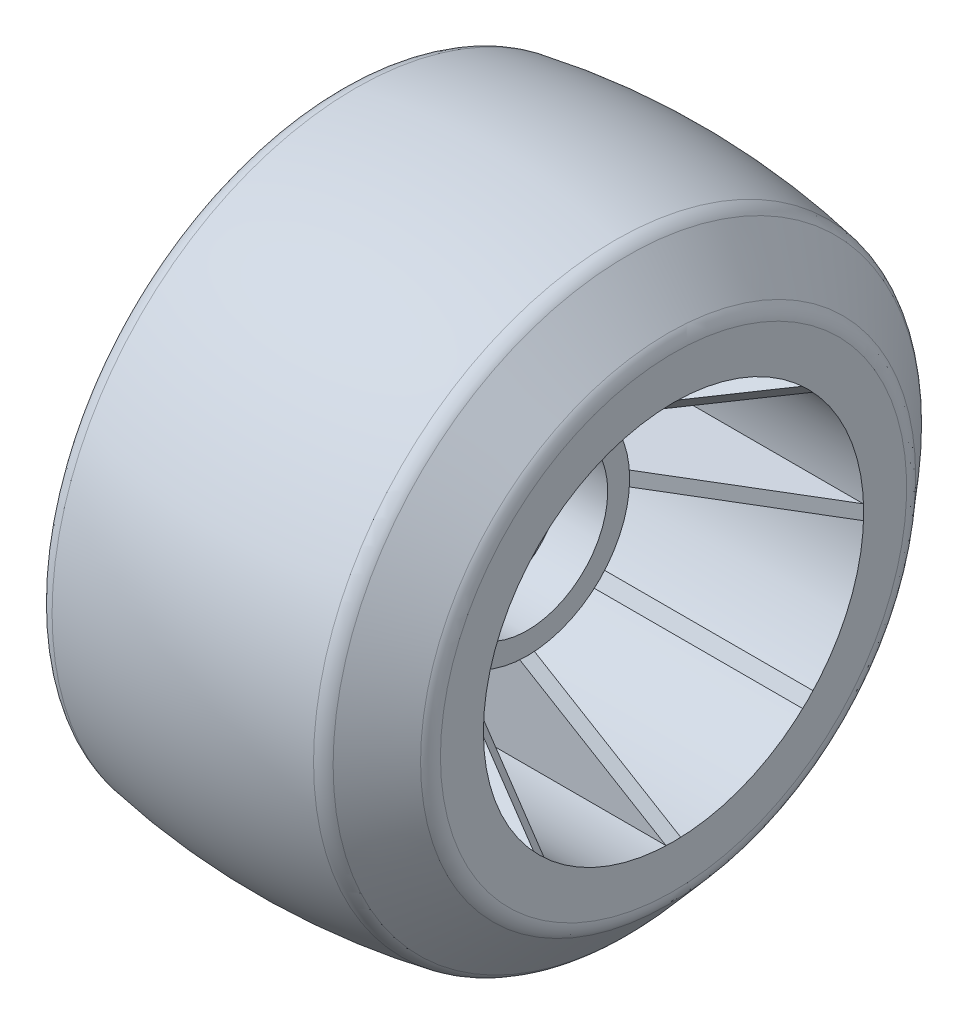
ISO-10303-21;
HEADER;
FILE_DESCRIPTION(('STEP AP214'),'2;1');
FILE_NAME('part.step','',(''),(''),'','','');
FILE_SCHEMA(('AUTOMOTIVE_DESIGN { 1 0 10303 214 1 1 1 1 }'));
ENDSEC;
DATA;
#1=APPLICATION_CONTEXT('core data for automotive mechanical design processes');
#2=APPLICATION_PROTOCOL_DEFINITION('international standard','automotive_design',2000,#1);
#3=PRODUCT_CONTEXT('',#1,'mechanical');
#4=PRODUCT('Part','Part','',(#3));
#5=PRODUCT_RELATED_PRODUCT_CATEGORY('part','',(#4));
#6=PRODUCT_DEFINITION_FORMATION('','',#4);
#7=PRODUCT_DEFINITION_CONTEXT('part definition',#1,'design');
#8=PRODUCT_DEFINITION('design','',#6,#7);
#9=PRODUCT_DEFINITION_SHAPE('','',#8);
#10=(LENGTH_UNIT() NAMED_UNIT(*) SI_UNIT(.MILLI.,.METRE.));
#11=(NAMED_UNIT(*) PLANE_ANGLE_UNIT() SI_UNIT($,.RADIAN.));
#12=(NAMED_UNIT(*) SI_UNIT($,.STERADIAN.) SOLID_ANGLE_UNIT());
#13=UNCERTAINTY_MEASURE_WITH_UNIT(LENGTH_MEASURE(1.E-05),#10,'distance_accuracy_value','');
#14=(GEOMETRIC_REPRESENTATION_CONTEXT(3) GLOBAL_UNCERTAINTY_ASSIGNED_CONTEXT((#13)) GLOBAL_UNIT_ASSIGNED_CONTEXT((#10,
#11,#12)) REPRESENTATION_CONTEXT('',''));
#15=CARTESIAN_POINT('',(0.,0.,0.));
#16=DIRECTION('',(0.,0.,1.));
#17=DIRECTION('',(1.,0.,0.));
#18=AXIS2_PLACEMENT_3D('',#15,#16,#17);
#19=CARTESIAN_POINT('',(-17.,0.,0.));
#20=DIRECTION('',(1.,0.,0.));
#21=DIRECTION('',(0.,0.,-1.));
#22=AXIS2_PLACEMENT_3D('',#19,#20,#21);
#23=PLANE('',#22);
#24=CARTESIAN_POINT('',(-17.,0.,0.));
#25=DIRECTION('',(1.,0.,0.));
#26=DIRECTION('',(0.,0.,-1.));
#27=AXIS2_PLACEMENT_3D('',#24,#25,#26);
#28=CIRCLE('',#27,26.);
#29=CARTESIAN_POINT('',(-17.,1.,-25.9807621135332));
#30=VERTEX_POINT('',#29);
#31=CARTESIAN_POINT('',(-17.,17.6640662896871,-19.0782798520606));
#32=VERTEX_POINT('',#31);
#33=EDGE_CURVE('E305',#30,#32,#28,.T.);
#34=ORIENTED_EDGE('',*,*,#33,.T.);
#35=DIRECTION('',(0.,-0.707106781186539,0.707106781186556));
#36=VECTOR('',#35,1.);
#37=CARTESIAN_POINT('',(-17.,-0.707106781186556,-0.707106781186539));
#38=LINE('',#37,#36);
#39=CARTESIAN_POINT('',(-17.,9.16710204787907,-10.5813156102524));
#40=VERTEX_POINT('',#39);
#41=EDGE_CURVE('E303',#32,#40,#38,.T.);
#42=ORIENTED_EDGE('',*,*,#41,.T.);
#43=CARTESIAN_POINT('',(-17.,0.,0.));
#44=DIRECTION('',(1.,0.,0.));
#45=DIRECTION('',(0.,0.,-1.));
#46=AXIS2_PLACEMENT_3D('',#43,#44,#45);
#47=CIRCLE('',#46,14.);
#48=CARTESIAN_POINT('',(-17.,1.,-13.9642400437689));
#49=VERTEX_POINT('',#48);
#50=EDGE_CURVE('E288',#49,#40,#47,.T.);
#51=ORIENTED_EDGE('',*,*,#50,.F.);
#52=DIRECTION('',(0.,0.,1.));
#53=VECTOR('',#52,1.);
#54=CARTESIAN_POINT('',(-17.,1.,0.));
#55=LINE('',#54,#53);
#56=EDGE_CURVE('E385',#30,#49,#55,.T.);
#57=ORIENTED_EDGE('',*,*,#56,.F.);
#58=EDGE_LOOP('',(#34,#42,#51,#57));
#59=FACE_BOUND('',#58,.T.);
#60=ADVANCED_FACE('F31',(#59),#23,.T.);
#61=CARTESIAN_POINT('',(-17.,0.,0.));
#62=DIRECTION('',(1.,0.,0.));
#63=DIRECTION('',(0.,0.,-1.));
#64=AXIS2_PLACEMENT_3D('',#61,#62,#63);
#65=CYLINDRICAL_SURFACE('',#64,26.);
#66=CARTESIAN_POINT('',(-17.,19.0782798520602,-17.6640662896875));
#67=VERTEX_POINT('',#66);
#68=CARTESIAN_POINT('',(-17.,25.9807621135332,-1.00000000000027));
#69=VERTEX_POINT('',#68);
#70=EDGE_CURVE('E377',#67,#69,#28,.T.);
#71=ORIENTED_EDGE('',*,*,#70,.F.);
#72=DIRECTION('',(1.,0.,0.));
#73=VECTOR('',#72,1.);
#74=CARTESIAN_POINT('',(-17.,19.0782798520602,-17.6640662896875));
#75=LINE('',#74,#73);
#76=CARTESIAN_POINT('',(22.9679368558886,19.0782798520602,-17.6640662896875));
#77=VERTEX_POINT('',#76);
#78=EDGE_CURVE('E46',#67,#77,#75,.T.);
#79=ORIENTED_EDGE('',*,*,#78,.T.);
#80=CARTESIAN_POINT('',(-20.3333333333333,0.,0.));
#81=DIRECTION('',(0.514495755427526,-0.606339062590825,0.60633906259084));
#82=DIRECTION('',(0.857492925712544,0.363803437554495,-0.363803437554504));
#83=AXIS2_PLACEMENT_3D('',#80,#81,#82);
#84=ELLIPSE('',#83,50.5349164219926,26.);
#85=CARTESIAN_POINT('',(23.,18.38477631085,-18.3847763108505));
#86=VERTEX_POINT('',#85);
#87=EDGE_CURVE('E555',#77,#86,#84,.F.);
#88=ORIENTED_EDGE('',*,*,#87,.T.);
#89=CARTESIAN_POINT('',(23.,0.,0.));
#90=DIRECTION('',(1.,0.,0.));
#91=DIRECTION('',(0.,0.,-1.));
#92=AXIS2_PLACEMENT_3D('',#89,#90,#91);
#93=CIRCLE('',#92,26.);
#94=CARTESIAN_POINT('',(23.,26.,-2.72335544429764E-13));
#95=VERTEX_POINT('',#94);
#96=EDGE_CURVE('E375',#86,#95,#93,.T.);
#97=ORIENTED_EDGE('',*,*,#96,.T.);
#98=CARTESIAN_POINT('',(-20.3333333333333,0.,0.));
#99=DIRECTION('',(0.514495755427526,-0.857492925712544,0.));
#100=DIRECTION('',(0.857492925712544,0.514495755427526,0.));
#101=AXIS2_PLACEMENT_3D('',#98,#99,#100);
#102=ELLIPSE('',#101,50.5349164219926,26.);
#103=CARTESIAN_POINT('',(22.9679368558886,25.9807621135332,-1.00000000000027));
#104=VERTEX_POINT('',#103);
#105=EDGE_CURVE('E537',#95,#104,#102,.F.);
#106=ORIENTED_EDGE('',*,*,#105,.T.);
#107=DIRECTION('',(1.,0.,0.));
#108=VECTOR('',#107,1.);
#109=CARTESIAN_POINT('',(-17.,25.9807621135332,-1.00000000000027));
#110=LINE('',#109,#108);
#111=EDGE_CURVE('E531',#69,#104,#110,.T.);
#112=ORIENTED_EDGE('',*,*,#111,.F.);
#113=EDGE_LOOP('',(#71,#79,#88,#97,#106,#112));
#114=FACE_BOUND('',#113,.T.);
#115=ADVANCED_FACE('F629',(#114),#65,.F.);
#116=CARTESIAN_POINT('',(3.,0.,0.));
#117=DIRECTION('',(-1.,0.,0.));
#118=DIRECTION('',(0.,0.,1.));
#119=AXIS2_PLACEMENT_3D('',#116,#117,#118);
#120=CYLINDRICAL_SURFACE('',#119,14.);
#121=CARTESIAN_POINT('',(-20.3333333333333,0.,0.));
#122=DIRECTION('',(0.514495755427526,-0.606339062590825,0.60633906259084));
#123=DIRECTION('',(-0.857492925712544,-0.363803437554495,0.363803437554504));
#124=AXIS2_PLACEMENT_3D('',#121,#122,#123);
#125=ELLIPSE('',#124,27.2111088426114,14.);
#126=CARTESIAN_POINT('',(3.,9.89949493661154,-9.89949493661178));
#127=VERTEX_POINT('',#126);
#128=CARTESIAN_POINT('',(2.94040007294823,10.5813156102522,-9.16710204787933));
#129=VERTEX_POINT('',#128);
#130=EDGE_CURVE('E558',#127,#129,#125,.T.);
#131=ORIENTED_EDGE('',*,*,#130,.T.);
#132=DIRECTION('',(-1.,0.,0.));
#133=VECTOR('',#132,1.);
#134=CARTESIAN_POINT('',(3.,10.5813156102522,-9.16710204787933));
#135=LINE('',#134,#133);
#136=CARTESIAN_POINT('',(-17.,10.5813156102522,-9.16710204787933));
#137=VERTEX_POINT('',#136);
#138=EDGE_CURVE('E11',#129,#137,#135,.T.);
#139=ORIENTED_EDGE('',*,*,#138,.T.);
#140=CARTESIAN_POINT('',(-17.,13.9642400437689,-1.00000000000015));
#141=VERTEX_POINT('',#140);
#142=EDGE_CURVE('E298',#137,#141,#47,.T.);
#143=ORIENTED_EDGE('',*,*,#142,.T.);
#144=DIRECTION('',(-1.,0.,0.));
#145=VECTOR('',#144,1.);
#146=CARTESIAN_POINT('',(3.,13.9642400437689,-1.00000000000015));
#147=LINE('',#146,#145);
#148=CARTESIAN_POINT('',(2.94040007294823,13.9642400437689,-1.00000000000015));
#149=VERTEX_POINT('',#148);
#150=EDGE_CURVE('E314',#149,#141,#147,.T.);
#151=ORIENTED_EDGE('',*,*,#150,.F.);
#152=CARTESIAN_POINT('',(-20.3333333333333,0.,0.));
#153=DIRECTION('',(0.514495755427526,-0.857492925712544,0.));
#154=DIRECTION('',(-0.857492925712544,-0.514495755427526,0.));
#155=AXIS2_PLACEMENT_3D('',#152,#153,#154);
#156=ELLIPSE('',#155,27.2111088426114,14.);
#157=CARTESIAN_POINT('',(3.,14.,-1.46642216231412E-13));
#158=VERTEX_POINT('',#157);
#159=EDGE_CURVE('E541',#149,#158,#156,.T.);
#160=ORIENTED_EDGE('',*,*,#159,.T.);
#161=CARTESIAN_POINT('',(3.,0.,0.));
#162=DIRECTION('',(1.,0.,0.));
#163=DIRECTION('',(0.,0.,-1.));
#164=AXIS2_PLACEMENT_3D('',#161,#162,#163);
#165=CIRCLE('',#164,14.);
#166=EDGE_CURVE('E382',#127,#158,#165,.T.);
#167=ORIENTED_EDGE('',*,*,#166,.F.);
#168=EDGE_LOOP('',(#131,#139,#143,#151,#160,#167));
#169=FACE_BOUND('',#168,.T.);
#170=ADVANCED_FACE('F635',(#169),#120,.T.);
#171=DIRECTION('',(0.,-0.707106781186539,0.707106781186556));
#172=VECTOR('',#171,1.);
#173=CARTESIAN_POINT('',(-17.,0.707106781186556,0.707106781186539));
#174=LINE('',#173,#172);
#175=EDGE_CURVE('E551',#67,#137,#174,.T.);
#176=ORIENTED_EDGE('',*,*,#175,.F.);
#177=ORIENTED_EDGE('',*,*,#70,.T.);
#178=DIRECTION('',(0.,-1.,0.));
#179=VECTOR('',#178,1.);
#180=CARTESIAN_POINT('',(-17.,0.,-1.));
#181=LINE('',#180,#179);
#182=EDGE_CURVE('E534',#69,#141,#181,.T.);
#183=ORIENTED_EDGE('',*,*,#182,.T.);
#184=ORIENTED_EDGE('',*,*,#142,.F.);
#185=EDGE_LOOP('',(#176,#177,#183,#184));
#186=FACE_BOUND('',#185,.T.);
#187=ADVANCED_FACE('F631',(#186),#23,.T.);
#188=CARTESIAN_POINT('',(-17.,25.9807621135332,0.999999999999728));
#189=VERTEX_POINT('',#188);
#190=CARTESIAN_POINT('',(-17.,19.0782798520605,17.6640662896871));
#191=VERTEX_POINT('',#190);
#192=EDGE_CURVE('E705',#189,#191,#28,.T.);
#193=ORIENTED_EDGE('',*,*,#192,.F.);
#194=DIRECTION('',(1.,0.,0.));
#195=VECTOR('',#194,1.);
#196=CARTESIAN_POINT('',(-17.,25.9807621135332,0.999999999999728));
#197=LINE('',#196,#195);
#198=CARTESIAN_POINT('',(22.9679368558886,25.9807621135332,0.999999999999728));
#199=VERTEX_POINT('',#198);
#200=EDGE_CURVE('E524',#189,#199,#197,.T.);
#201=ORIENTED_EDGE('',*,*,#200,.T.);
#202=EDGE_CURVE('E538',#199,#95,#102,.F.);
#203=ORIENTED_EDGE('',*,*,#202,.T.);
#204=CARTESIAN_POINT('',(23.,18.3847763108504,18.3847763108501));
#205=VERTEX_POINT('',#204);
#206=EDGE_CURVE('E723',#95,#205,#93,.T.);
#207=ORIENTED_EDGE('',*,*,#206,.T.);
#208=CARTESIAN_POINT('',(-20.3333333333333,0.,0.));
#209=DIRECTION('',(0.514495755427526,-0.606339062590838,-0.606339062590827));
#210=DIRECTION('',(0.857492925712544,0.363803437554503,0.363803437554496));
#211=AXIS2_PLACEMENT_3D('',#208,#209,#210);
#212=ELLIPSE('',#211,50.5349164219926,26.);
#213=CARTESIAN_POINT('',(22.9679368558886,19.0782798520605,17.6640662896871));
#214=VERTEX_POINT('',#213);
#215=EDGE_CURVE('E513',#205,#214,#212,.F.);
#216=ORIENTED_EDGE('',*,*,#215,.T.);
#217=DIRECTION('',(1.,0.,0.));
#218=VECTOR('',#217,1.);
#219=CARTESIAN_POINT('',(-17.,19.0782798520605,17.6640662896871));
#220=LINE('',#219,#218);
#221=EDGE_CURVE('E507',#191,#214,#220,.T.);
#222=ORIENTED_EDGE('',*,*,#221,.F.);
#223=EDGE_LOOP('',(#193,#201,#203,#207,#216,#222));
#224=FACE_BOUND('',#223,.T.);
#225=ADVANCED_FACE('F637',(#224),#65,.F.);
#226=CARTESIAN_POINT('',(2.94040007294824,13.964240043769,0.999999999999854));
#227=VERTEX_POINT('',#226);
#228=EDGE_CURVE('E542',#158,#227,#156,.T.);
#229=ORIENTED_EDGE('',*,*,#228,.T.);
#230=DIRECTION('',(-1.,0.,0.));
#231=VECTOR('',#230,1.);
#232=CARTESIAN_POINT('',(3.,13.964240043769,0.999999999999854));
#233=LINE('',#232,#231);
#234=CARTESIAN_POINT('',(-17.,13.964240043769,0.999999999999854));
#235=VERTEX_POINT('',#234);
#236=EDGE_CURVE('E313',#227,#235,#233,.T.);
#237=ORIENTED_EDGE('',*,*,#236,.T.);
#238=CARTESIAN_POINT('',(-17.,10.5813156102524,9.16710204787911));
#239=VERTEX_POINT('',#238);
#240=EDGE_CURVE('E707',#235,#239,#47,.T.);
#241=ORIENTED_EDGE('',*,*,#240,.T.);
#242=DIRECTION('',(-1.,0.,0.));
#243=VECTOR('',#242,1.);
#244=CARTESIAN_POINT('',(3.,10.5813156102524,9.16710204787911));
#245=LINE('',#244,#243);
#246=CARTESIAN_POINT('',(2.94040007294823,10.5813156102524,9.16710204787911));
#247=VERTEX_POINT('',#246);
#248=EDGE_CURVE('E321',#247,#239,#245,.T.);
#249=ORIENTED_EDGE('',*,*,#248,.F.);
#250=CARTESIAN_POINT('',(-20.3333333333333,0.,0.));
#251=DIRECTION('',(0.514495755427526,-0.606339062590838,-0.606339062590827));
#252=DIRECTION('',(-0.857492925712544,-0.363803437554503,-0.363803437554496));
#253=AXIS2_PLACEMENT_3D('',#250,#251,#252);
#254=ELLIPSE('',#253,27.2111088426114,14.);
#255=CARTESIAN_POINT('',(3.,9.89949493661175,9.89949493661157));
#256=VERTEX_POINT('',#255);
#257=EDGE_CURVE('E517',#247,#256,#254,.T.);
#258=ORIENTED_EDGE('',*,*,#257,.T.);
#259=EDGE_CURVE('E897',#158,#256,#165,.T.);
#260=ORIENTED_EDGE('',*,*,#259,.F.);
#261=EDGE_LOOP('',(#229,#237,#241,#249,#258,#260));
#262=FACE_BOUND('',#261,.T.);
#263=ADVANCED_FACE('F694',(#262),#120,.T.);
#264=DIRECTION('',(0.,-1.,0.));
#265=VECTOR('',#264,1.);
#266=CARTESIAN_POINT('',(-17.,0.,1.));
#267=LINE('',#266,#265);
#268=EDGE_CURVE('E528',#189,#235,#267,.T.);
#269=ORIENTED_EDGE('',*,*,#268,.F.);
#270=ORIENTED_EDGE('',*,*,#192,.T.);
#271=DIRECTION('',(0.,-0.707106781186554,-0.707106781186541));
#272=VECTOR('',#271,1.);
#273=CARTESIAN_POINT('',(-17.,0.707106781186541,-0.707106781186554));
#274=LINE('',#273,#272);
#275=EDGE_CURVE('E510',#191,#239,#274,.T.);
#276=ORIENTED_EDGE('',*,*,#275,.T.);
#277=ORIENTED_EDGE('',*,*,#240,.F.);
#278=EDGE_LOOP('',(#269,#270,#276,#277));
#279=FACE_BOUND('',#278,.T.);
#280=ADVANCED_FACE('F641',(#279),#23,.T.);
#281=CARTESIAN_POINT('',(-17.,17.6640662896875,19.0782798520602));
#282=VERTEX_POINT('',#281);
#283=CARTESIAN_POINT('',(-17.,1.00000000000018,25.9807621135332));
#284=VERTEX_POINT('',#283);
#285=EDGE_CURVE('E714',#282,#284,#28,.T.);
#286=ORIENTED_EDGE('',*,*,#285,.F.);
#287=DIRECTION('',(1.,0.,0.));
#288=VECTOR('',#287,1.);
#289=CARTESIAN_POINT('',(-17.,17.6640662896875,19.0782798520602));
#290=LINE('',#289,#288);
#291=CARTESIAN_POINT('',(22.9679368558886,17.6640662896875,19.0782798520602));
#292=VERTEX_POINT('',#291);
#293=EDGE_CURVE('E500',#282,#292,#290,.T.);
#294=ORIENTED_EDGE('',*,*,#293,.T.);
#295=EDGE_CURVE('E514',#292,#205,#212,.F.);
#296=ORIENTED_EDGE('',*,*,#295,.T.);
#297=CARTESIAN_POINT('',(23.,1.81557029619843E-13,26.));
#298=VERTEX_POINT('',#297);
#299=EDGE_CURVE('E730',#205,#298,#93,.T.);
#300=ORIENTED_EDGE('',*,*,#299,.T.);
#301=CARTESIAN_POINT('',(-20.3333333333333,0.,0.));
#302=DIRECTION('',(0.514495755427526,0.,-0.857492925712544));
#303=DIRECTION('',(0.857492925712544,0.,0.514495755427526));
#304=AXIS2_PLACEMENT_3D('',#301,#302,#303);
#305=ELLIPSE('',#304,50.5349164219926,26.);
#306=CARTESIAN_POINT('',(22.9679368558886,1.00000000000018,25.9807621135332));
#307=VERTEX_POINT('',#306);
#308=EDGE_CURVE('E489',#298,#307,#305,.F.);
#309=ORIENTED_EDGE('',*,*,#308,.T.);
#310=DIRECTION('',(1.,0.,0.));
#311=VECTOR('',#310,1.);
#312=CARTESIAN_POINT('',(-17.,1.00000000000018,25.9807621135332));
#313=LINE('',#312,#311);
#314=EDGE_CURVE('E483',#284,#307,#313,.T.);
#315=ORIENTED_EDGE('',*,*,#314,.F.);
#316=EDGE_LOOP('',(#286,#294,#296,#300,#309,#315));
#317=FACE_BOUND('',#316,.T.);
#318=ADVANCED_FACE('F692',(#317),#65,.F.);
#319=CARTESIAN_POINT('',(2.94040007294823,9.16710204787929,10.5813156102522));
#320=VERTEX_POINT('',#319);
#321=EDGE_CURVE('E518',#256,#320,#254,.T.);
#322=ORIENTED_EDGE('',*,*,#321,.T.);
#323=DIRECTION('',(-1.,0.,0.));
#324=VECTOR('',#323,1.);
#325=CARTESIAN_POINT('',(3.,9.16710204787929,10.5813156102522));
#326=LINE('',#325,#324);
#327=CARTESIAN_POINT('',(-17.,9.16710204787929,10.5813156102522));
#328=VERTEX_POINT('',#327);
#329=EDGE_CURVE('E319',#320,#328,#326,.T.);
#330=ORIENTED_EDGE('',*,*,#329,.T.);
#331=CARTESIAN_POINT('',(-17.,1.0000000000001,13.9642400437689));
#332=VERTEX_POINT('',#331);
#333=EDGE_CURVE('E793',#328,#332,#47,.T.);
#334=ORIENTED_EDGE('',*,*,#333,.T.);
#335=DIRECTION('',(-1.,0.,0.));
#336=VECTOR('',#335,1.);
#337=CARTESIAN_POINT('',(3.,1.0000000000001,13.9642400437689));
#338=LINE('',#337,#336);
#339=CARTESIAN_POINT('',(2.94040007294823,1.0000000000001,13.9642400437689));
#340=VERTEX_POINT('',#339);
#341=EDGE_CURVE('E326',#340,#332,#338,.T.);
#342=ORIENTED_EDGE('',*,*,#341,.F.);
#343=CARTESIAN_POINT('',(-20.3333333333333,0.,0.));
#344=DIRECTION('',(0.514495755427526,0.,-0.857492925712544));
#345=DIRECTION('',(-0.857492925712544,0.,-0.514495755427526));
#346=AXIS2_PLACEMENT_3D('',#343,#344,#345);
#347=ELLIPSE('',#346,27.2111088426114,14.);
#348=CARTESIAN_POINT('',(3.,0.,14.));
#349=VERTEX_POINT('',#348);
#350=EDGE_CURVE('E493',#340,#349,#347,.T.);
#351=ORIENTED_EDGE('',*,*,#350,.T.);
#352=EDGE_CURVE('E900',#256,#349,#165,.T.);
#353=ORIENTED_EDGE('',*,*,#352,.F.);
#354=EDGE_LOOP('',(#322,#330,#334,#342,#351,#353));
#355=FACE_BOUND('',#354,.T.);
#356=ADVANCED_FACE('F684',(#355),#120,.T.);
#357=DIRECTION('',(0.,-0.707106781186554,-0.707106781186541));
#358=VECTOR('',#357,1.);
#359=CARTESIAN_POINT('',(-17.,-0.707106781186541,0.707106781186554));
#360=LINE('',#359,#358);
#361=EDGE_CURVE('E504',#282,#328,#360,.T.);
#362=ORIENTED_EDGE('',*,*,#361,.F.);
#363=ORIENTED_EDGE('',*,*,#285,.T.);
#364=DIRECTION('',(0.,0.,-1.));
#365=VECTOR('',#364,1.);
#366=CARTESIAN_POINT('',(-17.,1.,0.));
#367=LINE('',#366,#365);
#368=EDGE_CURVE('E486',#284,#332,#367,.T.);
#369=ORIENTED_EDGE('',*,*,#368,.T.);
#370=ORIENTED_EDGE('',*,*,#333,.F.);
#371=EDGE_LOOP('',(#362,#363,#369,#370));
#372=FACE_BOUND('',#371,.T.);
#373=ADVANCED_FACE('F676',(#372),#23,.T.);
#374=CARTESIAN_POINT('',(-17.,-0.999999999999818,25.9807621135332));
#375=VERTEX_POINT('',#374);
#376=CARTESIAN_POINT('',(-17.,-17.6640662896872,19.0782798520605));
#377=VERTEX_POINT('',#376);
#378=EDGE_CURVE('E775',#375,#377,#28,.T.);
#379=ORIENTED_EDGE('',*,*,#378,.F.);
#380=DIRECTION('',(1.,0.,0.));
#381=VECTOR('',#380,1.);
#382=CARTESIAN_POINT('',(-17.,-0.999999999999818,25.9807621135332));
#383=LINE('',#382,#381);
#384=CARTESIAN_POINT('',(22.9679368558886,-0.999999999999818,25.9807621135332));
#385=VERTEX_POINT('',#384);
#386=EDGE_CURVE('E476',#375,#385,#383,.T.);
#387=ORIENTED_EDGE('',*,*,#386,.T.);
#388=EDGE_CURVE('E490',#385,#298,#305,.F.);
#389=ORIENTED_EDGE('',*,*,#388,.T.);
#390=CARTESIAN_POINT('',(23.,-18.3847763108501,18.3847763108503));
#391=VERTEX_POINT('',#390);
#392=EDGE_CURVE('E732',#298,#391,#93,.T.);
#393=ORIENTED_EDGE('',*,*,#392,.T.);
#394=CARTESIAN_POINT('',(-20.3333333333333,0.,0.));
#395=DIRECTION('',(0.514495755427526,0.606339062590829,-0.606339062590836));
#396=DIRECTION('',(0.857492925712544,-0.363803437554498,0.363803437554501));
#397=AXIS2_PLACEMENT_3D('',#394,#395,#396);
#398=ELLIPSE('',#397,50.5349164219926,26.);
#399=CARTESIAN_POINT('',(22.9679368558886,-17.6640662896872,19.0782798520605));
#400=VERTEX_POINT('',#399);
#401=EDGE_CURVE('E465',#391,#400,#398,.F.);
#402=ORIENTED_EDGE('',*,*,#401,.T.);
#403=DIRECTION('',(1.,0.,0.));
#404=VECTOR('',#403,1.);
#405=CARTESIAN_POINT('',(-17.,-17.6640662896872,19.0782798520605));
#406=LINE('',#405,#404);
#407=EDGE_CURVE('E459',#377,#400,#406,.T.);
#408=ORIENTED_EDGE('',*,*,#407,.F.);
#409=EDGE_LOOP('',(#379,#387,#389,#393,#402,#408));
#410=FACE_BOUND('',#409,.T.);
#411=ADVANCED_FACE('F682',(#410),#65,.F.);
#412=CARTESIAN_POINT('',(2.94040007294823,-0.999999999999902,13.9642400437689));
#413=VERTEX_POINT('',#412);
#414=EDGE_CURVE('E494',#349,#413,#347,.T.);
#415=ORIENTED_EDGE('',*,*,#414,.T.);
#416=DIRECTION('',(-1.,0.,0.));
#417=VECTOR('',#416,1.);
#418=CARTESIAN_POINT('',(3.,-0.999999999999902,13.9642400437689));
#419=LINE('',#418,#417);
#420=CARTESIAN_POINT('',(-17.,-0.999999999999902,13.9642400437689));
#421=VERTEX_POINT('',#420);
#422=EDGE_CURVE('E324',#413,#421,#419,.T.);
#423=ORIENTED_EDGE('',*,*,#422,.T.);
#424=CARTESIAN_POINT('',(-17.,-9.16710204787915,10.5813156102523));
#425=VERTEX_POINT('',#424);
#426=EDGE_CURVE('E806',#421,#425,#47,.T.);
#427=ORIENTED_EDGE('',*,*,#426,.T.);
#428=DIRECTION('',(-1.,0.,0.));
#429=VECTOR('',#428,1.);
#430=CARTESIAN_POINT('',(3.,-9.16710204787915,10.5813156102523));
#431=LINE('',#430,#429);
#432=CARTESIAN_POINT('',(2.94040007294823,-9.16710204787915,10.5813156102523));
#433=VERTEX_POINT('',#432);
#434=EDGE_CURVE('E331',#433,#425,#431,.T.);
#435=ORIENTED_EDGE('',*,*,#434,.F.);
#436=CARTESIAN_POINT('',(-20.3333333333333,0.,0.));
#437=DIRECTION('',(0.514495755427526,0.606339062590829,-0.606339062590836));
#438=DIRECTION('',(-0.857492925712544,0.363803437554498,-0.363803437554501));
#439=AXIS2_PLACEMENT_3D('',#436,#437,#438);
#440=ELLIPSE('',#439,27.2111088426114,14.);
#441=CARTESIAN_POINT('',(3.,-9.89949493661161,9.89949493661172));
#442=VERTEX_POINT('',#441);
#443=EDGE_CURVE('E469',#433,#442,#440,.T.);
#444=ORIENTED_EDGE('',*,*,#443,.T.);
#445=EDGE_CURVE('E802',#349,#442,#165,.T.);
#446=ORIENTED_EDGE('',*,*,#445,.F.);
#447=EDGE_LOOP('',(#415,#423,#427,#435,#444,#446));
#448=FACE_BOUND('',#447,.T.);
#449=ADVANCED_FACE('F673',(#448),#120,.T.);
#450=DIRECTION('',(0.,0.,-1.));
#451=VECTOR('',#450,1.);
#452=CARTESIAN_POINT('',(-17.,-1.,0.));
#453=LINE('',#452,#451);
#454=EDGE_CURVE('E480',#375,#421,#453,.T.);
#455=ORIENTED_EDGE('',*,*,#454,.F.);
#456=ORIENTED_EDGE('',*,*,#378,.T.);
#457=DIRECTION('',(0.,0.707106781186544,-0.707106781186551));
#458=VECTOR('',#457,1.);
#459=CARTESIAN_POINT('',(-17.,0.707106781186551,0.707106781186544));
#460=LINE('',#459,#458);
#461=EDGE_CURVE('E462',#377,#425,#460,.T.);
#462=ORIENTED_EDGE('',*,*,#461,.T.);
#463=ORIENTED_EDGE('',*,*,#426,.F.);
#464=EDGE_LOOP('',(#455,#456,#462,#463));
#465=FACE_BOUND('',#464,.T.);
#466=ADVANCED_FACE('F665',(#465),#23,.T.);
#467=CARTESIAN_POINT('',(-17.,-19.0782798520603,17.6640662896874));
#468=VERTEX_POINT('',#467);
#469=CARTESIAN_POINT('',(-17.,-25.9807621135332,1.00000000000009));
#470=VERTEX_POINT('',#469);
#471=EDGE_CURVE('E774',#468,#470,#28,.T.);
#472=ORIENTED_EDGE('',*,*,#471,.F.);
#473=DIRECTION('',(1.,0.,0.));
#474=VECTOR('',#473,1.);
#475=CARTESIAN_POINT('',(-17.,-19.0782798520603,17.6640662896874));
#476=LINE('',#475,#474);
#477=CARTESIAN_POINT('',(22.9679368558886,-19.0782798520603,17.6640662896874));
#478=VERTEX_POINT('',#477);
#479=EDGE_CURVE('E452',#468,#478,#476,.T.);
#480=ORIENTED_EDGE('',*,*,#479,.T.);
#481=EDGE_CURVE('E466',#478,#391,#398,.F.);
#482=ORIENTED_EDGE('',*,*,#481,.T.);
#483=CARTESIAN_POINT('',(23.,-26.,0.));
#484=VERTEX_POINT('',#483);
#485=EDGE_CURVE('E733',#391,#484,#93,.T.);
#486=ORIENTED_EDGE('',*,*,#485,.T.);
#487=CARTESIAN_POINT('',(-20.3333333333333,0.,0.));
#488=DIRECTION('',(0.514495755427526,0.857492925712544,0.));
#489=DIRECTION('',(0.857492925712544,-0.514495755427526,0.));
#490=AXIS2_PLACEMENT_3D('',#487,#488,#489);
#491=ELLIPSE('',#490,50.5349164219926,26.);
#492=CARTESIAN_POINT('',(22.9679368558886,-25.9807621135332,1.00000000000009));
#493=VERTEX_POINT('',#492);
#494=EDGE_CURVE('E441',#484,#493,#491,.F.);
#495=ORIENTED_EDGE('',*,*,#494,.T.);
#496=DIRECTION('',(1.,0.,0.));
#497=VECTOR('',#496,1.);
#498=CARTESIAN_POINT('',(-17.,-25.9807621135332,1.00000000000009));
#499=LINE('',#498,#497);
#500=EDGE_CURVE('E435',#470,#493,#499,.T.);
#501=ORIENTED_EDGE('',*,*,#500,.F.);
#502=EDGE_LOOP('',(#472,#480,#482,#486,#495,#501));
#503=FACE_BOUND('',#502,.T.);
#504=ADVANCED_FACE('F671',(#503),#65,.F.);
#505=CARTESIAN_POINT('',(2.94040007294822,-10.5813156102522,9.16710204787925));
#506=VERTEX_POINT('',#505);
#507=EDGE_CURVE('E470',#442,#506,#440,.T.);
#508=ORIENTED_EDGE('',*,*,#507,.T.);
#509=DIRECTION('',(-1.,0.,0.));
#510=VECTOR('',#509,1.);
#511=CARTESIAN_POINT('',(3.,-10.5813156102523,9.16710204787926));
#512=LINE('',#511,#510);
#513=CARTESIAN_POINT('',(-17.,-10.5813156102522,9.16710204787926));
#514=VERTEX_POINT('',#513);
#515=EDGE_CURVE('E329',#506,#514,#512,.T.);
#516=ORIENTED_EDGE('',*,*,#515,.T.);
#517=CARTESIAN_POINT('',(-17.,-13.9642400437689,1.00000000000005));
#518=VERTEX_POINT('',#517);
#519=EDGE_CURVE('E826',#514,#518,#47,.T.);
#520=ORIENTED_EDGE('',*,*,#519,.T.);
#521=DIRECTION('',(-1.,0.,0.));
#522=VECTOR('',#521,1.);
#523=CARTESIAN_POINT('',(3.,-13.9642400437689,1.00000000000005));
#524=LINE('',#523,#522);
#525=CARTESIAN_POINT('',(2.94040007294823,-13.9642400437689,1.00000000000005));
#526=VERTEX_POINT('',#525);
#527=EDGE_CURVE('E336',#526,#518,#524,.T.);
#528=ORIENTED_EDGE('',*,*,#527,.F.);
#529=CARTESIAN_POINT('',(-20.3333333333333,0.,0.));
#530=DIRECTION('',(0.514495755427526,0.857492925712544,0.));
#531=DIRECTION('',(-0.857492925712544,0.514495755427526,0.));
#532=AXIS2_PLACEMENT_3D('',#529,#530,#531);
#533=ELLIPSE('',#532,27.2111088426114,14.);
#534=CARTESIAN_POINT('',(3.,-14.,0.));
#535=VERTEX_POINT('',#534);
#536=EDGE_CURVE('E445',#526,#535,#533,.T.);
#537=ORIENTED_EDGE('',*,*,#536,.T.);
#538=EDGE_CURVE('E822',#442,#535,#165,.T.);
#539=ORIENTED_EDGE('',*,*,#538,.F.);
#540=EDGE_LOOP('',(#508,#516,#520,#528,#537,#539));
#541=FACE_BOUND('',#540,.T.);
#542=ADVANCED_FACE('F662',(#541),#120,.T.);
#543=DIRECTION('',(0.,0.707106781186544,-0.707106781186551));
#544=VECTOR('',#543,1.);
#545=CARTESIAN_POINT('',(-17.,-0.707106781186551,-0.707106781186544));
#546=LINE('',#545,#544);
#547=EDGE_CURVE('E456',#468,#514,#546,.T.);
#548=ORIENTED_EDGE('',*,*,#547,.F.);
#549=ORIENTED_EDGE('',*,*,#471,.T.);
#550=DIRECTION('',(0.,1.,0.));
#551=VECTOR('',#550,1.);
#552=CARTESIAN_POINT('',(-17.,0.,1.));
#553=LINE('',#552,#551);
#554=EDGE_CURVE('E438',#470,#518,#553,.T.);
#555=ORIENTED_EDGE('',*,*,#554,.T.);
#556=ORIENTED_EDGE('',*,*,#519,.F.);
#557=EDGE_LOOP('',(#548,#549,#555,#556));
#558=FACE_BOUND('',#557,.T.);
#559=ADVANCED_FACE('F654',(#558),#23,.T.);
#560=CARTESIAN_POINT('',(-17.,-25.9807621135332,-0.999999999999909));
#561=VERTEX_POINT('',#560);
#562=CARTESIAN_POINT('',(-17.,-19.0782798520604,-17.6640662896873));
#563=VERTEX_POINT('',#562);
#564=EDGE_CURVE('E756',#561,#563,#28,.T.);
#565=ORIENTED_EDGE('',*,*,#564,.F.);
#566=DIRECTION('',(1.,0.,0.));
#567=VECTOR('',#566,1.);
#568=CARTESIAN_POINT('',(-17.,-25.9807621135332,-0.999999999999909));
#569=LINE('',#568,#567);
#570=CARTESIAN_POINT('',(22.9679368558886,-25.9807621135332,-0.999999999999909));
#571=VERTEX_POINT('',#570);
#572=EDGE_CURVE('E428',#561,#571,#569,.T.);
#573=ORIENTED_EDGE('',*,*,#572,.T.);
#574=EDGE_CURVE('E442',#571,#484,#491,.F.);
#575=ORIENTED_EDGE('',*,*,#574,.T.);
#576=CARTESIAN_POINT('',(23.,-18.3847763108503,-18.3847763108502));
#577=VERTEX_POINT('',#576);
#578=EDGE_CURVE('E734',#484,#577,#93,.T.);
#579=ORIENTED_EDGE('',*,*,#578,.T.);
#580=CARTESIAN_POINT('',(-20.3333333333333,0.,0.));
#581=DIRECTION('',(0.514495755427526,0.606339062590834,0.606339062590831));
#582=DIRECTION('',(0.857492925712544,-0.3638034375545,-0.363803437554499));
#583=AXIS2_PLACEMENT_3D('',#580,#581,#582);
#584=ELLIPSE('',#583,50.5349164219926,26.);
#585=CARTESIAN_POINT('',(22.9679368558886,-19.0782798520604,-17.6640662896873));
#586=VERTEX_POINT('',#585);
#587=EDGE_CURVE('E417',#577,#586,#584,.F.);
#588=ORIENTED_EDGE('',*,*,#587,.T.);
#589=DIRECTION('',(1.,0.,0.));
#590=VECTOR('',#589,1.);
#591=CARTESIAN_POINT('',(-17.,-19.0782798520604,-17.6640662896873));
#592=LINE('',#591,#590);
#593=EDGE_CURVE('E411',#563,#586,#592,.T.);
#594=ORIENTED_EDGE('',*,*,#593,.F.);
#595=EDGE_LOOP('',(#565,#573,#575,#579,#588,#594));
#596=FACE_BOUND('',#595,.T.);
#597=ADVANCED_FACE('F660',(#596),#65,.F.);
#598=CARTESIAN_POINT('',(2.94040007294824,-13.9642400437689,-0.999999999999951));
#599=VERTEX_POINT('',#598);
#600=EDGE_CURVE('E446',#535,#599,#533,.T.);
#601=ORIENTED_EDGE('',*,*,#600,.T.);
#602=DIRECTION('',(-1.,0.,0.));
#603=VECTOR('',#602,1.);
#604=CARTESIAN_POINT('',(3.,-13.9642400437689,-0.999999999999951));
#605=LINE('',#604,#603);
#606=CARTESIAN_POINT('',(-17.,-13.9642400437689,-0.999999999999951));
#607=VERTEX_POINT('',#606);
#608=EDGE_CURVE('E334',#599,#607,#605,.T.);
#609=ORIENTED_EDGE('',*,*,#608,.T.);
#610=CARTESIAN_POINT('',(-17.,-10.5813156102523,-9.16710204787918));
#611=VERTEX_POINT('',#610);
#612=EDGE_CURVE('E772',#607,#611,#47,.T.);
#613=ORIENTED_EDGE('',*,*,#612,.T.);
#614=DIRECTION('',(-1.,0.,0.));
#615=VECTOR('',#614,1.);
#616=CARTESIAN_POINT('',(3.,-10.5813156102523,-9.16710204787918));
#617=LINE('',#616,#615);
#618=CARTESIAN_POINT('',(2.94040007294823,-10.5813156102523,-9.16710204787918));
#619=VERTEX_POINT('',#618);
#620=EDGE_CURVE('E341',#619,#611,#617,.T.);
#621=ORIENTED_EDGE('',*,*,#620,.F.);
#622=CARTESIAN_POINT('',(-20.3333333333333,0.,0.));
#623=DIRECTION('',(0.514495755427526,0.606339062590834,0.606339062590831));
#624=DIRECTION('',(-0.857492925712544,0.3638034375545,0.363803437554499));
#625=AXIS2_PLACEMENT_3D('',#622,#623,#624);
#626=ELLIPSE('',#625,27.2111088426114,14.);
#627=CARTESIAN_POINT('',(3.,-9.89949493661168,-9.89949493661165));
#628=VERTEX_POINT('',#627);
#629=EDGE_CURVE('E421',#619,#628,#626,.T.);
#630=ORIENTED_EDGE('',*,*,#629,.T.);
#631=EDGE_CURVE('E841',#535,#628,#165,.T.);
#632=ORIENTED_EDGE('',*,*,#631,.F.);
#633=EDGE_LOOP('',(#601,#609,#613,#621,#630,#632));
#634=FACE_BOUND('',#633,.T.);
#635=ADVANCED_FACE('F651',(#634),#120,.T.);
#636=DIRECTION('',(0.,1.,0.));
#637=VECTOR('',#636,1.);
#638=CARTESIAN_POINT('',(-17.,0.,-1.));
#639=LINE('',#638,#637);
#640=EDGE_CURVE('E432',#561,#607,#639,.T.);
#641=ORIENTED_EDGE('',*,*,#640,.F.);
#642=ORIENTED_EDGE('',*,*,#564,.T.);
#643=DIRECTION('',(0.,0.707106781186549,0.707106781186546));
#644=VECTOR('',#643,1.);
#645=CARTESIAN_POINT('',(-17.,-0.707106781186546,0.707106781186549));
#646=LINE('',#645,#644);
#647=EDGE_CURVE('E414',#563,#611,#646,.T.);
#648=ORIENTED_EDGE('',*,*,#647,.T.);
#649=ORIENTED_EDGE('',*,*,#612,.F.);
#650=EDGE_LOOP('',(#641,#642,#648,#649));
#651=FACE_BOUND('',#650,.T.);
#652=ADVANCED_FACE('F645',(#651),#23,.T.);
#653=CARTESIAN_POINT('',(-17.,-17.6640662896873,-19.0782798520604));
#654=VERTEX_POINT('',#653);
#655=CARTESIAN_POINT('',(-17.,-1.,-25.9807621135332));
#656=VERTEX_POINT('',#655);
#657=EDGE_CURVE('E374',#654,#656,#28,.T.);
#658=ORIENTED_EDGE('',*,*,#657,.F.);
#659=DIRECTION('',(1.,0.,0.));
#660=VECTOR('',#659,1.);
#661=CARTESIAN_POINT('',(-17.,-17.6640662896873,-19.0782798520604));
#662=LINE('',#661,#660);
#663=CARTESIAN_POINT('',(22.9679368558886,-17.6640662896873,-19.0782798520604));
#664=VERTEX_POINT('',#663);
#665=EDGE_CURVE('E404',#654,#664,#662,.T.);
#666=ORIENTED_EDGE('',*,*,#665,.T.);
#667=EDGE_CURVE('E418',#664,#577,#584,.F.);
#668=ORIENTED_EDGE('',*,*,#667,.T.);
#669=CARTESIAN_POINT('',(23.,0.,-26.));
#670=VERTEX_POINT('',#669);
#671=EDGE_CURVE('E376',#577,#670,#93,.T.);
#672=ORIENTED_EDGE('',*,*,#671,.T.);
#673=CARTESIAN_POINT('',(-20.3333333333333,0.,0.));
#674=DIRECTION('',(0.514495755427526,0.,0.857492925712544));
#675=DIRECTION('',(0.857492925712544,0.,-0.514495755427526));
#676=AXIS2_PLACEMENT_3D('',#673,#674,#675);
#677=ELLIPSE('',#676,50.5349164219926,26.);
#678=CARTESIAN_POINT('',(22.9679368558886,-1.,-25.9807621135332));
#679=VERTEX_POINT('',#678);
#680=EDGE_CURVE('E393',#670,#679,#677,.F.);
#681=ORIENTED_EDGE('',*,*,#680,.T.);
#682=DIRECTION('',(1.,0.,0.));
#683=VECTOR('',#682,1.);
#684=CARTESIAN_POINT('',(-17.,-1.,-25.9807621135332));
#685=LINE('',#684,#683);
#686=EDGE_CURVE('E387',#656,#679,#685,.T.);
#687=ORIENTED_EDGE('',*,*,#686,.F.);
#688=EDGE_LOOP('',(#658,#666,#668,#672,#681,#687));
#689=FACE_BOUND('',#688,.T.);
#690=ADVANCED_FACE('F649',(#689),#65,.F.);
#691=CARTESIAN_POINT('',(2.94040007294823,-9.16710204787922,-10.5813156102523));
#692=VERTEX_POINT('',#691);
#693=EDGE_CURVE('E422',#628,#692,#626,.T.);
#694=ORIENTED_EDGE('',*,*,#693,.T.);
#695=DIRECTION('',(-1.,0.,0.));
#696=VECTOR('',#695,1.);
#697=CARTESIAN_POINT('',(3.,-9.16710204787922,-10.5813156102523));
#698=LINE('',#697,#696);
#699=CARTESIAN_POINT('',(-17.,-9.16710204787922,-10.5813156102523));
#700=VERTEX_POINT('',#699);
#701=EDGE_CURVE('E339',#692,#700,#698,.T.);
#702=ORIENTED_EDGE('',*,*,#701,.T.);
#703=CARTESIAN_POINT('',(-17.,-1.,-13.9642400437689));
#704=VERTEX_POINT('',#703);
#705=EDGE_CURVE('E300',#700,#704,#47,.T.);
#706=ORIENTED_EDGE('',*,*,#705,.T.);
#707=DIRECTION('',(-1.,0.,0.));
#708=VECTOR('',#707,1.);
#709=CARTESIAN_POINT('',(3.,-1.,-13.9642400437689));
#710=LINE('',#709,#708);
#711=CARTESIAN_POINT('',(2.94040007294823,-1.,-13.9642400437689));
#712=VERTEX_POINT('',#711);
#713=EDGE_CURVE('E345',#712,#704,#710,.T.);
#714=ORIENTED_EDGE('',*,*,#713,.F.);
#715=CARTESIAN_POINT('',(-20.3333333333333,0.,0.));
#716=DIRECTION('',(0.514495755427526,0.,0.857492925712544));
#717=DIRECTION('',(-0.857492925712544,0.,0.514495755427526));
#718=AXIS2_PLACEMENT_3D('',#715,#716,#717);
#719=ELLIPSE('',#718,27.2111088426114,14.);
#720=CARTESIAN_POINT('',(3.,0.,-14.));
#721=VERTEX_POINT('',#720);
#722=EDGE_CURVE('E397',#712,#721,#719,.T.);
#723=ORIENTED_EDGE('',*,*,#722,.T.);
#724=EDGE_CURVE('E297',#628,#721,#165,.T.);
#725=ORIENTED_EDGE('',*,*,#724,.F.);
#726=EDGE_LOOP('',(#694,#702,#706,#714,#723,#725));
#727=FACE_BOUND('',#726,.T.);
#728=ADVANCED_FACE('F643',(#727),#120,.T.);
#729=DIRECTION('',(0.,0.707106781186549,0.707106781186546));
#730=VECTOR('',#729,1.);
#731=CARTESIAN_POINT('',(-17.,0.707106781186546,-0.707106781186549));
#732=LINE('',#731,#730);
#733=EDGE_CURVE('E408',#654,#700,#732,.T.);
#734=ORIENTED_EDGE('',*,*,#733,.F.);
#735=ORIENTED_EDGE('',*,*,#657,.T.);
#736=DIRECTION('',(0.,0.,1.));
#737=VECTOR('',#736,1.);
#738=CARTESIAN_POINT('',(-17.,-1.,0.));
#739=LINE('',#738,#737);
#740=EDGE_CURVE('E390',#656,#704,#739,.T.);
#741=ORIENTED_EDGE('',*,*,#740,.T.);
#742=ORIENTED_EDGE('',*,*,#705,.F.);
#743=EDGE_LOOP('',(#734,#735,#741,#742));
#744=FACE_BOUND('',#743,.T.);
#745=ADVANCED_FACE('F615',(#744),#23,.T.);
#746=CARTESIAN_POINT('',(-23.,41.,0.));
#747=DIRECTION('',(1.,0.,0.));
#748=DIRECTION('',(0.,0.,-1.));
#749=AXIS2_PLACEMENT_3D('',#746,#747,#748);
#750=PLANE('',#749);
#751=CARTESIAN_POINT('',(-23.,0.,0.));
#752=DIRECTION('',(-1.,0.,0.));
#753=DIRECTION('',(0.,0.,1.));
#754=AXIS2_PLACEMENT_3D('',#751,#752,#753);
#755=CIRCLE('',#754,28.);
#756=CARTESIAN_POINT('',(-23.,0.,28.));
#757=VERTEX_POINT('',#756);
#758=EDGE_CURVE('E367',#757,#757,#755,.T.);
#759=ORIENTED_EDGE('',*,*,#758,.F.);
#760=EDGE_LOOP('',(#759));
#761=FACE_BOUND('',#760,.T.);
#762=CARTESIAN_POINT('',(-23.,0.,0.));
#763=DIRECTION('',(1.,0.,0.));
#764=DIRECTION('',(0.,0.,-1.));
#765=AXIS2_PLACEMENT_3D('',#762,#763,#764);
#766=CIRCLE('',#765,38.5060241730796);
#767=CARTESIAN_POINT('',(-23.,0.,-38.5060241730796));
#768=VERTEX_POINT('',#767);
#769=EDGE_CURVE('E348',#768,#768,#766,.F.);
#770=ORIENTED_EDGE('',*,*,#769,.T.);
#771=EDGE_LOOP('',(#770));
#772=FACE_BOUND('',#771,.T.);
#773=ADVANCED_FACE('F611',(#761,#772),#750,.F.);
#774=CARTESIAN_POINT('',(23.,33.,0.));
#775=DIRECTION('',(-1.,0.,0.));
#776=DIRECTION('',(0.,0.,1.));
#777=AXIS2_PLACEMENT_3D('',#774,#775,#776);
#778=PLANE('',#777);
#779=ORIENTED_EDGE('',*,*,#96,.F.);
#780=EDGE_CURVE('E372',#670,#86,#93,.T.);
#781=ORIENTED_EDGE('',*,*,#780,.F.);
#782=ORIENTED_EDGE('',*,*,#671,.F.);
#783=ORIENTED_EDGE('',*,*,#578,.F.);
#784=ORIENTED_EDGE('',*,*,#485,.F.);
#785=ORIENTED_EDGE('',*,*,#392,.F.);
#786=ORIENTED_EDGE('',*,*,#299,.F.);
#787=ORIENTED_EDGE('',*,*,#206,.F.);
#788=EDGE_LOOP('',(#779,#781,#782,#783,#784,#785,#786,#787));
#789=FACE_BOUND('',#788,.T.);
#790=CARTESIAN_POINT('',(23.,0.,0.));
#791=DIRECTION('',(-1.,0.,0.));
#792=DIRECTION('',(0.,0.,1.));
#793=AXIS2_PLACEMENT_3D('',#790,#791,#792);
#794=CIRCLE('',#793,31.8727946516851);
#795=CARTESIAN_POINT('',(23.,0.,31.8727946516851));
#796=VERTEX_POINT('',#795);
#797=EDGE_CURVE('E357',#796,#796,#794,.F.);
#798=ORIENTED_EDGE('',*,*,#797,.T.);
#799=EDGE_LOOP('',(#798));
#800=FACE_BOUND('',#799,.T.);
#801=ADVANCED_FACE('F614',(#789,#800),#778,.F.);
#802=CARTESIAN_POINT('',(23.,0.,0.));
#803=DIRECTION('',(-1.,0.,0.));
#804=DIRECTION('',(0.,0.,1.));
#805=AXIS2_PLACEMENT_3D('',#802,#803,#804);
#806=CONICAL_SURFACE('',#805,33.,0.851966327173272);
#807=CARTESIAN_POINT('',(16.6776488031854,0.,0.));
#808=DIRECTION('',(1.,0.,0.));
#809=DIRECTION('',(0.,0.,-1.));
#810=AXIS2_PLACEMENT_3D('',#807,#808,#809);
#811=CIRCLE('',#810,40.2255442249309);
#812=CARTESIAN_POINT('',(16.6776488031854,0.,-40.2255442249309));
#813=VERTEX_POINT('',#812);
#814=EDGE_CURVE('E363',#813,#813,#811,.T.);
#815=ORIENTED_EDGE('',*,*,#814,.T.);
#816=EDGE_LOOP('',(#815));
#817=FACE_BOUND('',#816,.T.);
#818=CARTESIAN_POINT('',(22.2577300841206,0.,0.));
#819=DIRECTION('',(1.,0.,0.));
#820=DIRECTION('',(0.,0.,-1.));
#821=AXIS2_PLACEMENT_3D('',#818,#819,#820);
#822=CIRCLE('',#821,33.8483084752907);
#823=CARTESIAN_POINT('',(22.2577300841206,0.,-33.8483084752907));
#824=VERTEX_POINT('',#823);
#825=EDGE_CURVE('E360',#824,#824,#822,.F.);
#826=ORIENTED_EDGE('',*,*,#825,.T.);
#827=EDGE_LOOP('',(#826));
#828=FACE_BOUND('',#827,.T.);
#829=ADVANCED_FACE('F1264',(#817,#828),#806,.T.);
#830=CARTESIAN_POINT('',(-3.5,0.,0.));
#831=DIRECTION('',(-1.,0.,0.));
#832=DIRECTION('',(0.,0.,1.));
#833=AXIS2_PLACEMENT_3D('',#830,#831,#832);
#834=DEGENERATE_TOROIDAL_SURFACE('',#833,57.0803242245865,100.,.F.);
#835=CARTESIAN_POINT('',(-20.5103092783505,0.,0.));
#836=DIRECTION('',(1.,0.,0.));
#837=DIRECTION('',(0.,0.,-1.));
#838=AXIS2_PLACEMENT_3D('',#835,#836,#837);
#839=CIRCLE('',#838,41.4623029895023);
#840=CARTESIAN_POINT('',(-20.5103092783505,0.,-41.4623029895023));
#841=VERTEX_POINT('',#840);
#842=EDGE_CURVE('E354',#841,#841,#839,.T.);
#843=ORIENTED_EDGE('',*,*,#842,.T.);
#844=EDGE_LOOP('',(#843));
#845=FACE_BOUND('',#844,.T.);
#846=CARTESIAN_POINT('',(14.9741430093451,0.,0.));
#847=DIRECTION('',(-1.,0.,0.));
#848=DIRECTION('',(0.,0.,1.));
#849=AXIS2_PLACEMENT_3D('',#846,#847,#848);
#850=CIRCLE('',#849,41.198391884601);
#851=CARTESIAN_POINT('',(14.9741430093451,0.,41.198391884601));
#852=VERTEX_POINT('',#851);
#853=EDGE_CURVE('E351',#852,#852,#850,.T.);
#854=ORIENTED_EDGE('',*,*,#853,.T.);
#855=EDGE_LOOP('',(#854));
#856=FACE_BOUND('',#855,.T.);
#857=ADVANCED_FACE('F1261',(#845,#856),#834,.F.);
#858=CARTESIAN_POINT('',(20.,0.,0.));
#859=DIRECTION('',(-1.,0.,0.));
#860=DIRECTION('',(0.,0.,1.));
#861=AXIS2_PLACEMENT_3D('',#858,#859,#860);
#862=TOROIDAL_SURFACE('',#861,31.8727946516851,3.);
#863=ORIENTED_EDGE('',*,*,#797,.F.);
#864=EDGE_LOOP('',(#863));
#865=FACE_BOUND('',#864,.T.);
#866=ORIENTED_EDGE('',*,*,#825,.F.);
#867=EDGE_LOOP('',(#866));
#868=FACE_BOUND('',#867,.T.);
#869=ADVANCED_FACE('F625',(#865,#868),#862,.T.);
#870=CARTESIAN_POINT('',(14.4199187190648,0.,0.));
#871=DIRECTION('',(1.,0.,0.));
#872=DIRECTION('',(0.,0.,-1.));
#873=AXIS2_PLACEMENT_3D('',#870,#871,#872);
#874=TOROIDAL_SURFACE('',#873,38.2500304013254,3.);
#875=ORIENTED_EDGE('',*,*,#814,.F.);
#876=EDGE_LOOP('',(#875));
#877=FACE_BOUND('',#876,.T.);
#878=ORIENTED_EDGE('',*,*,#853,.F.);
#879=EDGE_LOOP('',(#878));
#880=FACE_BOUND('',#879,.T.);
#881=ADVANCED_FACE('F620',(#877,#880),#874,.T.);
#882=CARTESIAN_POINT('',(-20.,0.,0.));
#883=DIRECTION('',(1.,0.,0.));
#884=DIRECTION('',(0.,0.,-1.));
#885=AXIS2_PLACEMENT_3D('',#882,#883,#884);
#886=TOROIDAL_SURFACE('',#885,38.5060241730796,3.);
#887=ORIENTED_EDGE('',*,*,#842,.F.);
#888=EDGE_LOOP('',(#887));
#889=FACE_BOUND('',#888,.T.);
#890=ORIENTED_EDGE('',*,*,#769,.F.);
#891=EDGE_LOOP('',(#890));
#892=FACE_BOUND('',#891,.T.);
#893=ADVANCED_FACE('F33',(#889,#892),#886,.T.);
#894=CARTESIAN_POINT('',(-21.5,0.,0.));
#895=DIRECTION('',(-1.,0.,0.));
#896=DIRECTION('',(0.,0.,1.));
#897=AXIS2_PLACEMENT_3D('',#894,#895,#896);
#898=CYLINDRICAL_SURFACE('',#897,28.);
#899=CARTESIAN_POINT('',(-21.5,0.,0.));
#900=DIRECTION('',(-1.,0.,0.));
#901=DIRECTION('',(0.,0.,1.));
#902=AXIS2_PLACEMENT_3D('',#899,#900,#901);
#903=CIRCLE('',#902,28.);
#904=CARTESIAN_POINT('',(-21.5,0.,28.));
#905=VERTEX_POINT('',#904);
#906=EDGE_CURVE('E366',#905,#905,#903,.T.);
#907=ORIENTED_EDGE('',*,*,#906,.F.);
#908=EDGE_LOOP('',(#907));
#909=FACE_BOUND('',#908,.T.);
#910=ORIENTED_EDGE('',*,*,#758,.T.);
#911=EDGE_LOOP('',(#910));
#912=FACE_BOUND('',#911,.T.);
#913=ADVANCED_FACE('F602',(#909,#912),#898,.F.);
#914=CARTESIAN_POINT('',(-21.5,0.,0.));
#915=DIRECTION('',(-1.,0.,0.));
#916=DIRECTION('',(0.,0.,1.));
#917=AXIS2_PLACEMENT_3D('',#914,#915,#916);
#918=PLANE('',#917);
#919=CARTESIAN_POINT('',(-21.5,0.,0.));
#920=DIRECTION('',(-1.,0.,0.));
#921=DIRECTION('',(0.,0.,1.));
#922=AXIS2_PLACEMENT_3D('',#919,#920,#921);
#923=CIRCLE('',#922,11.);
#924=CARTESIAN_POINT('',(-21.5,0.,11.));
#925=VERTEX_POINT('',#924);
#926=EDGE_CURVE('E571',#925,#925,#923,.T.);
#927=ORIENTED_EDGE('',*,*,#926,.F.);
#928=EDGE_LOOP('',(#927));
#929=FACE_BOUND('',#928,.T.);
#930=ORIENTED_EDGE('',*,*,#906,.T.);
#931=EDGE_LOOP('',(#930));
#932=FACE_BOUND('',#931,.T.);
#933=ADVANCED_FACE('F598',(#929,#932),#918,.T.);
#934=ORIENTED_EDGE('',*,*,#780,.T.);
#935=CARTESIAN_POINT('',(22.9679368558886,17.6640662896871,-19.0782798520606));
#936=VERTEX_POINT('',#935);
#937=EDGE_CURVE('E54',#86,#936,#84,.F.);
#938=ORIENTED_EDGE('',*,*,#937,.T.);
#939=DIRECTION('',(1.,0.,0.));
#940=VECTOR('',#939,1.);
#941=CARTESIAN_POINT('',(-17.,17.6640662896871,-19.0782798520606));
#942=LINE('',#941,#940);
#943=EDGE_CURVE('E307',#32,#936,#942,.T.);
#944=ORIENTED_EDGE('',*,*,#943,.F.);
#945=ORIENTED_EDGE('',*,*,#33,.F.);
#946=DIRECTION('',(1.,0.,0.));
#947=VECTOR('',#946,1.);
#948=CARTESIAN_POINT('',(-17.,1.,-25.9807621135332));
#949=LINE('',#948,#947);
#950=CARTESIAN_POINT('',(22.9679368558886,1.,-25.9807621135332));
#951=VERTEX_POINT('',#950);
#952=EDGE_CURVE('E383',#30,#951,#949,.T.);
#953=ORIENTED_EDGE('',*,*,#952,.T.);
#954=EDGE_CURVE('E394',#951,#670,#677,.F.);
#955=ORIENTED_EDGE('',*,*,#954,.T.);
#956=EDGE_LOOP('',(#934,#938,#944,#945,#953,#955));
#957=FACE_BOUND('',#956,.T.);
#958=ADVANCED_FACE('F601',(#957),#65,.F.);
#959=DIRECTION('',(-1.,0.,0.));
#960=VECTOR('',#959,1.);
#961=CARTESIAN_POINT('',(3.,9.16710204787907,-10.5813156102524));
#962=LINE('',#961,#960);
#963=CARTESIAN_POINT('',(2.94040007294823,9.16710204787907,-10.5813156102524));
#964=VERTEX_POINT('',#963);
#965=EDGE_CURVE('E39',#964,#40,#962,.T.);
#966=ORIENTED_EDGE('',*,*,#965,.F.);
#967=EDGE_CURVE('E557',#964,#127,#125,.T.);
#968=ORIENTED_EDGE('',*,*,#967,.T.);
#969=EDGE_CURVE('E379',#721,#127,#165,.T.);
#970=ORIENTED_EDGE('',*,*,#969,.F.);
#971=CARTESIAN_POINT('',(2.94040007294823,1.,-13.9642400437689));
#972=VERTEX_POINT('',#971);
#973=EDGE_CURVE('E398',#721,#972,#719,.T.);
#974=ORIENTED_EDGE('',*,*,#973,.T.);
#975=DIRECTION('',(-1.,0.,0.));
#976=VECTOR('',#975,1.);
#977=CARTESIAN_POINT('',(3.,1.,-13.9642400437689));
#978=LINE('',#977,#976);
#979=EDGE_CURVE('E294',#972,#49,#978,.T.);
#980=ORIENTED_EDGE('',*,*,#979,.T.);
#981=ORIENTED_EDGE('',*,*,#50,.T.);
#982=EDGE_LOOP('',(#966,#968,#970,#974,#980,#981));
#983=FACE_BOUND('',#982,.T.);
#984=ADVANCED_FACE('F290',(#983),#120,.T.);
#985=CARTESIAN_POINT('',(3.,0.,0.));
#986=DIRECTION('',(1.,0.,0.));
#987=DIRECTION('',(0.,0.,-1.));
#988=AXIS2_PLACEMENT_3D('',#985,#986,#987);
#989=PLANE('',#988);
#990=CARTESIAN_POINT('',(3.,0.,0.));
#991=DIRECTION('',(1.,0.,0.));
#992=DIRECTION('',(0.,0.,-1.));
#993=AXIS2_PLACEMENT_3D('',#990,#991,#992);
#994=CIRCLE('',#993,11.);
#995=CARTESIAN_POINT('',(3.,0.,-11.));
#996=VERTEX_POINT('',#995);
#997=EDGE_CURVE('E565',#996,#996,#994,.T.);
#998=ORIENTED_EDGE('',*,*,#997,.F.);
#999=EDGE_LOOP('',(#998));
#1000=FACE_BOUND('',#999,.T.);
#1001=ORIENTED_EDGE('',*,*,#969,.T.);
#1002=ORIENTED_EDGE('',*,*,#166,.T.);
#1003=ORIENTED_EDGE('',*,*,#259,.T.);
#1004=ORIENTED_EDGE('',*,*,#352,.T.);
#1005=ORIENTED_EDGE('',*,*,#445,.T.);
#1006=ORIENTED_EDGE('',*,*,#538,.T.);
#1007=ORIENTED_EDGE('',*,*,#631,.T.);
#1008=ORIENTED_EDGE('',*,*,#724,.T.);
#1009=EDGE_LOOP('',(#1001,#1002,#1003,#1004,#1005,#1006,#1007,#1008));
#1010=FACE_BOUND('',#1009,.T.);
#1011=ADVANCED_FACE('F864',(#1000,#1010),#989,.T.);
#1012=CARTESIAN_POINT('',(0.,1.,0.));
#1013=DIRECTION('',(0.,1.,0.));
#1014=DIRECTION('',(0.,0.,1.));
#1015=AXIS2_PLACEMENT_3D('',#1012,#1013,#1014);
#1016=PLANE('',#1015);
#1017=ORIENTED_EDGE('',*,*,#952,.F.);
#1018=ORIENTED_EDGE('',*,*,#56,.T.);
#1019=ORIENTED_EDGE('',*,*,#979,.F.);
#1020=DIRECTION('',(0.857492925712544,0.,-0.514495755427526));
#1021=VECTOR('',#1020,1.);
#1022=CARTESIAN_POINT('',(3.,1.,-14.));
#1023=LINE('',#1022,#1021);
#1024=EDGE_CURVE('E400',#972,#951,#1023,.T.);
#1025=ORIENTED_EDGE('',*,*,#1024,.T.);
#1026=EDGE_LOOP('',(#1017,#1018,#1019,#1025));
#1027=FACE_BOUND('',#1026,.T.);
#1028=ADVANCED_FACE('F861',(#1027),#1016,.T.);
#1029=CARTESIAN_POINT('',(0.,-1.,0.));
#1030=DIRECTION('',(0.,1.,0.));
#1031=DIRECTION('',(0.,0.,1.));
#1032=AXIS2_PLACEMENT_3D('',#1029,#1030,#1031);
#1033=PLANE('',#1032);
#1034=ORIENTED_EDGE('',*,*,#740,.F.);
#1035=ORIENTED_EDGE('',*,*,#686,.T.);
#1036=DIRECTION('',(0.857492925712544,0.,-0.514495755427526));
#1037=VECTOR('',#1036,1.);
#1038=CARTESIAN_POINT('',(3.,-1.,-14.));
#1039=LINE('',#1038,#1037);
#1040=EDGE_CURVE('E401',#712,#679,#1039,.T.);
#1041=ORIENTED_EDGE('',*,*,#1040,.F.);
#1042=ORIENTED_EDGE('',*,*,#713,.T.);
#1043=EDGE_LOOP('',(#1034,#1035,#1041,#1042));
#1044=FACE_BOUND('',#1043,.T.);
#1045=ADVANCED_FACE('F754',(#1044),#1033,.F.);
#1046=CARTESIAN_POINT('',(3.,0.,-14.));
#1047=DIRECTION('',(0.514495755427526,0.,0.857492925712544));
#1048=DIRECTION('',(0.857492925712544,0.,-0.514495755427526));
#1049=AXIS2_PLACEMENT_3D('',#1046,#1047,#1048);
#1050=PLANE('',#1049);
#1051=ORIENTED_EDGE('',*,*,#680,.F.);
#1052=ORIENTED_EDGE('',*,*,#954,.F.);
#1053=ORIENTED_EDGE('',*,*,#1024,.F.);
#1054=ORIENTED_EDGE('',*,*,#973,.F.);
#1055=ORIENTED_EDGE('',*,*,#722,.F.);
#1056=ORIENTED_EDGE('',*,*,#1040,.T.);
#1057=EDGE_LOOP('',(#1051,#1052,#1053,#1054,#1055,#1056));
#1058=FACE_BOUND('',#1057,.T.);
#1059=ADVANCED_FACE('F747',(#1058),#1050,.T.);
#1060=CARTESIAN_POINT('',(0.,0.707106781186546,-0.707106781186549));
#1061=DIRECTION('',(0.,0.707106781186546,-0.707106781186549));
#1062=DIRECTION('',(0.,0.707106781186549,0.707106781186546));
#1063=AXIS2_PLACEMENT_3D('',#1060,#1061,#1062);
#1064=PLANE('',#1063);
#1065=ORIENTED_EDGE('',*,*,#665,.F.);
#1066=ORIENTED_EDGE('',*,*,#733,.T.);
#1067=ORIENTED_EDGE('',*,*,#701,.F.);
#1068=DIRECTION('',(0.857492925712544,-0.3638034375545,-0.363803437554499));
#1069=VECTOR('',#1068,1.);
#1070=CARTESIAN_POINT('',(3.,-9.19238815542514,-10.6066017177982));
#1071=LINE('',#1070,#1069);
#1072=EDGE_CURVE('E424',#692,#664,#1071,.T.);
#1073=ORIENTED_EDGE('',*,*,#1072,.T.);
#1074=EDGE_LOOP('',(#1065,#1066,#1067,#1073));
#1075=FACE_BOUND('',#1074,.T.);
#1076=ADVANCED_FACE('F758',(#1075),#1064,.T.);
#1077=CARTESIAN_POINT('',(0.,-0.707106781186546,0.707106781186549));
#1078=DIRECTION('',(0.,0.707106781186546,-0.707106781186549));
#1079=DIRECTION('',(0.,0.707106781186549,0.707106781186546));
#1080=AXIS2_PLACEMENT_3D('',#1077,#1078,#1079);
#1081=PLANE('',#1080);
#1082=ORIENTED_EDGE('',*,*,#647,.F.);
#1083=ORIENTED_EDGE('',*,*,#593,.T.);
#1084=DIRECTION('',(0.857492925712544,-0.3638034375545,-0.363803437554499));
#1085=VECTOR('',#1084,1.);
#1086=CARTESIAN_POINT('',(3.,-10.6066017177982,-9.1923881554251));
#1087=LINE('',#1086,#1085);
#1088=EDGE_CURVE('E425',#619,#586,#1087,.T.);
#1089=ORIENTED_EDGE('',*,*,#1088,.F.);
#1090=ORIENTED_EDGE('',*,*,#620,.T.);
#1091=EDGE_LOOP('',(#1082,#1083,#1089,#1090));
#1092=FACE_BOUND('',#1091,.T.);
#1093=ADVANCED_FACE('F770',(#1092),#1081,.F.);
#1094=CARTESIAN_POINT('',(3.,-9.89949493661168,-9.89949493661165));
#1095=DIRECTION('',(0.514495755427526,0.606339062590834,0.606339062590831));
#1096=DIRECTION('',(0.857492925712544,-0.3638034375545,-0.363803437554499));
#1097=AXIS2_PLACEMENT_3D('',#1094,#1095,#1096);
#1098=PLANE('',#1097);
#1099=ORIENTED_EDGE('',*,*,#587,.F.);
#1100=ORIENTED_EDGE('',*,*,#667,.F.);
#1101=ORIENTED_EDGE('',*,*,#1072,.F.);
#1102=ORIENTED_EDGE('',*,*,#693,.F.);
#1103=ORIENTED_EDGE('',*,*,#629,.F.);
#1104=ORIENTED_EDGE('',*,*,#1088,.T.);
#1105=EDGE_LOOP('',(#1099,#1100,#1101,#1102,#1103,#1104));
#1106=FACE_BOUND('',#1105,.T.);
#1107=ADVANCED_FACE('F763',(#1106),#1098,.T.);
#1108=CARTESIAN_POINT('',(0.,0.,-1.));
#1109=DIRECTION('',(0.,0.,-1.));
#1110=DIRECTION('',(0.,1.,0.));
#1111=AXIS2_PLACEMENT_3D('',#1108,#1109,#1110);
#1112=PLANE('',#1111);
#1113=ORIENTED_EDGE('',*,*,#572,.F.);
#1114=ORIENTED_EDGE('',*,*,#640,.T.);
#1115=ORIENTED_EDGE('',*,*,#608,.F.);
#1116=DIRECTION('',(0.857492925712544,-0.514495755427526,0.));
#1117=VECTOR('',#1116,1.);
#1118=CARTESIAN_POINT('',(3.,-14.,-0.999999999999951));
#1119=LINE('',#1118,#1117);
#1120=EDGE_CURVE('E448',#599,#571,#1119,.T.);
#1121=ORIENTED_EDGE('',*,*,#1120,.T.);
#1122=EDGE_LOOP('',(#1113,#1114,#1115,#1121));
#1123=FACE_BOUND('',#1122,.T.);
#1124=ADVANCED_FACE('F843',(#1123),#1112,.T.);
#1125=CARTESIAN_POINT('',(0.,0.,1.));
#1126=DIRECTION('',(0.,0.,-1.));
#1127=DIRECTION('',(0.,1.,0.));
#1128=AXIS2_PLACEMENT_3D('',#1125,#1126,#1127);
#1129=PLANE('',#1128);
#1130=ORIENTED_EDGE('',*,*,#554,.F.);
#1131=ORIENTED_EDGE('',*,*,#500,.T.);
#1132=DIRECTION('',(0.857492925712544,-0.514495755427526,0.));
#1133=VECTOR('',#1132,1.);
#1134=CARTESIAN_POINT('',(3.,-14.,1.00000000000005));
#1135=LINE('',#1134,#1133);
#1136=EDGE_CURVE('E449',#526,#493,#1135,.T.);
#1137=ORIENTED_EDGE('',*,*,#1136,.F.);
#1138=ORIENTED_EDGE('',*,*,#527,.T.);
#1139=EDGE_LOOP('',(#1130,#1131,#1137,#1138));
#1140=FACE_BOUND('',#1139,.T.);
#1141=ADVANCED_FACE('F831',(#1140),#1129,.F.);
#1142=CARTESIAN_POINT('',(3.,-14.,0.));
#1143=DIRECTION('',(0.514495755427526,0.857492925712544,0.));
#1144=DIRECTION('',(0.857492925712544,-0.514495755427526,0.));
#1145=AXIS2_PLACEMENT_3D('',#1142,#1143,#1144);
#1146=PLANE('',#1145);
#1147=ORIENTED_EDGE('',*,*,#494,.F.);
#1148=ORIENTED_EDGE('',*,*,#574,.F.);
#1149=ORIENTED_EDGE('',*,*,#1120,.F.);
#1150=ORIENTED_EDGE('',*,*,#600,.F.);
#1151=ORIENTED_EDGE('',*,*,#536,.F.);
#1152=ORIENTED_EDGE('',*,*,#1136,.T.);
#1153=EDGE_LOOP('',(#1147,#1148,#1149,#1150,#1151,#1152));
#1154=FACE_BOUND('',#1153,.T.);
#1155=ADVANCED_FACE('F836',(#1154),#1146,.T.);
#1156=CARTESIAN_POINT('',(0.,-0.707106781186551,-0.707106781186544));
#1157=DIRECTION('',(0.,-0.707106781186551,-0.707106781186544));
#1158=DIRECTION('',(0.,0.707106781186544,-0.707106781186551));
#1159=AXIS2_PLACEMENT_3D('',#1156,#1157,#1158);
#1160=PLANE('',#1159);
#1161=ORIENTED_EDGE('',*,*,#479,.F.);
#1162=ORIENTED_EDGE('',*,*,#547,.T.);
#1163=ORIENTED_EDGE('',*,*,#515,.F.);
#1164=DIRECTION('',(0.857492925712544,-0.363803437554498,0.363803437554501));
#1165=VECTOR('',#1164,1.);
#1166=CARTESIAN_POINT('',(3.,-10.6066017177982,9.19238815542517));
#1167=LINE('',#1166,#1165);
#1168=EDGE_CURVE('E472',#506,#478,#1167,.T.);
#1169=ORIENTED_EDGE('',*,*,#1168,.T.);
#1170=EDGE_LOOP('',(#1161,#1162,#1163,#1169));
#1171=FACE_BOUND('',#1170,.T.);
#1172=ADVANCED_FACE('F825',(#1171),#1160,.T.);
#1173=CARTESIAN_POINT('',(0.,0.707106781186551,0.707106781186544));
#1174=DIRECTION('',(0.,-0.707106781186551,-0.707106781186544));
#1175=DIRECTION('',(0.,0.707106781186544,-0.707106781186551));
#1176=AXIS2_PLACEMENT_3D('',#1173,#1174,#1175);
#1177=PLANE('',#1176);
#1178=ORIENTED_EDGE('',*,*,#461,.F.);
#1179=ORIENTED_EDGE('',*,*,#407,.T.);
#1180=DIRECTION('',(0.857492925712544,-0.363803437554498,0.363803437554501));
#1181=VECTOR('',#1180,1.);
#1182=CARTESIAN_POINT('',(3.,-9.19238815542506,10.6066017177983));
#1183=LINE('',#1182,#1181);
#1184=EDGE_CURVE('E473',#433,#400,#1183,.T.);
#1185=ORIENTED_EDGE('',*,*,#1184,.F.);
#1186=ORIENTED_EDGE('',*,*,#434,.T.);
#1187=EDGE_LOOP('',(#1178,#1179,#1185,#1186));
#1188=FACE_BOUND('',#1187,.T.);
#1189=ADVANCED_FACE('F811',(#1188),#1177,.F.);
#1190=CARTESIAN_POINT('',(3.,-9.89949493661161,9.89949493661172));
#1191=DIRECTION('',(0.514495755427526,0.606339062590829,-0.606339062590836));
#1192=DIRECTION('',(0.857492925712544,-0.363803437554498,0.363803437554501));
#1193=AXIS2_PLACEMENT_3D('',#1190,#1191,#1192);
#1194=PLANE('',#1193);
#1195=ORIENTED_EDGE('',*,*,#401,.F.);
#1196=ORIENTED_EDGE('',*,*,#481,.F.);
#1197=ORIENTED_EDGE('',*,*,#1168,.F.);
#1198=ORIENTED_EDGE('',*,*,#507,.F.);
#1199=ORIENTED_EDGE('',*,*,#443,.F.);
#1200=ORIENTED_EDGE('',*,*,#1184,.T.);
#1201=EDGE_LOOP('',(#1195,#1196,#1197,#1198,#1199,#1200));
#1202=FACE_BOUND('',#1201,.T.);
#1203=ADVANCED_FACE('F816',(#1202),#1194,.T.);
#1204=CARTESIAN_POINT('',(0.,-1.,0.));
#1205=DIRECTION('',(0.,-1.,0.));
#1206=DIRECTION('',(0.,0.,-1.));
#1207=AXIS2_PLACEMENT_3D('',#1204,#1205,#1206);
#1208=PLANE('',#1207);
#1209=ORIENTED_EDGE('',*,*,#386,.F.);
#1210=ORIENTED_EDGE('',*,*,#454,.T.);
#1211=ORIENTED_EDGE('',*,*,#422,.F.);
#1212=DIRECTION('',(0.857492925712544,0.,0.514495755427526));
#1213=VECTOR('',#1212,1.);
#1214=CARTESIAN_POINT('',(3.,-0.999999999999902,14.));
#1215=LINE('',#1214,#1213);
#1216=EDGE_CURVE('E496',#413,#385,#1215,.T.);
#1217=ORIENTED_EDGE('',*,*,#1216,.T.);
#1218=EDGE_LOOP('',(#1209,#1210,#1211,#1217));
#1219=FACE_BOUND('',#1218,.T.);
#1220=ADVANCED_FACE('F805',(#1219),#1208,.T.);
#1221=CARTESIAN_POINT('',(0.,1.,0.));
#1222=DIRECTION('',(0.,-1.,0.));
#1223=DIRECTION('',(0.,0.,-1.));
#1224=AXIS2_PLACEMENT_3D('',#1221,#1222,#1223);
#1225=PLANE('',#1224);
#1226=ORIENTED_EDGE('',*,*,#368,.F.);
#1227=ORIENTED_EDGE('',*,*,#314,.T.);
#1228=DIRECTION('',(0.857492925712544,0.,0.514495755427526));
#1229=VECTOR('',#1228,1.);
#1230=CARTESIAN_POINT('',(3.,1.0000000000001,14.));
#1231=LINE('',#1230,#1229);
#1232=EDGE_CURVE('E497',#340,#307,#1231,.T.);
#1233=ORIENTED_EDGE('',*,*,#1232,.F.);
#1234=ORIENTED_EDGE('',*,*,#341,.T.);
#1235=EDGE_LOOP('',(#1226,#1227,#1233,#1234));
#1236=FACE_BOUND('',#1235,.T.);
#1237=ADVANCED_FACE('F788',(#1236),#1225,.F.);
#1238=CARTESIAN_POINT('',(3.,0.,14.));
#1239=DIRECTION('',(0.514495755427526,0.,-0.857492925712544));
#1240=DIRECTION('',(0.857492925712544,0.,0.514495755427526));
#1241=AXIS2_PLACEMENT_3D('',#1238,#1239,#1240);
#1242=PLANE('',#1241);
#1243=ORIENTED_EDGE('',*,*,#308,.F.);
#1244=ORIENTED_EDGE('',*,*,#388,.F.);
#1245=ORIENTED_EDGE('',*,*,#1216,.F.);
#1246=ORIENTED_EDGE('',*,*,#414,.F.);
#1247=ORIENTED_EDGE('',*,*,#350,.F.);
#1248=ORIENTED_EDGE('',*,*,#1232,.T.);
#1249=EDGE_LOOP('',(#1243,#1244,#1245,#1246,#1247,#1248));
#1250=FACE_BOUND('',#1249,.T.);
#1251=ADVANCED_FACE('F796',(#1250),#1242,.T.);
#1252=CARTESIAN_POINT('',(0.,-0.707106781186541,0.707106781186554));
#1253=DIRECTION('',(0.,-0.707106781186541,0.707106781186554));
#1254=DIRECTION('',(0.,-0.707106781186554,-0.707106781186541));
#1255=AXIS2_PLACEMENT_3D('',#1252,#1253,#1254);
#1256=PLANE('',#1255);
#1257=ORIENTED_EDGE('',*,*,#293,.F.);
#1258=ORIENTED_EDGE('',*,*,#361,.T.);
#1259=ORIENTED_EDGE('',*,*,#329,.F.);
#1260=DIRECTION('',(0.857492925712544,0.363803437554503,0.363803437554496));
#1261=VECTOR('',#1260,1.);
#1262=CARTESIAN_POINT('',(3.,9.19238815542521,10.6066017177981));
#1263=LINE('',#1262,#1261);
#1264=EDGE_CURVE('E520',#320,#292,#1263,.T.);
#1265=ORIENTED_EDGE('',*,*,#1264,.T.);
#1266=EDGE_LOOP('',(#1257,#1258,#1259,#1265));
#1267=FACE_BOUND('',#1266,.T.);
#1268=ADVANCED_FACE('F914',(#1267),#1256,.T.);
#1269=CARTESIAN_POINT('',(0.,0.707106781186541,-0.707106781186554));
#1270=DIRECTION('',(0.,-0.707106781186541,0.707106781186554));
#1271=DIRECTION('',(0.,-0.707106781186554,-0.707106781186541));
#1272=AXIS2_PLACEMENT_3D('',#1269,#1270,#1271);
#1273=PLANE('',#1272);
#1274=ORIENTED_EDGE('',*,*,#275,.F.);
#1275=ORIENTED_EDGE('',*,*,#221,.T.);
#1276=DIRECTION('',(0.857492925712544,0.363803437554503,0.363803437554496));
#1277=VECTOR('',#1276,1.);
#1278=CARTESIAN_POINT('',(3.,10.6066017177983,9.19238815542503));
#1279=LINE('',#1278,#1277);
#1280=EDGE_CURVE('E521',#247,#214,#1279,.T.);
#1281=ORIENTED_EDGE('',*,*,#1280,.F.);
#1282=ORIENTED_EDGE('',*,*,#248,.T.);
#1283=EDGE_LOOP('',(#1274,#1275,#1281,#1282));
#1284=FACE_BOUND('',#1283,.T.);
#1285=ADVANCED_FACE('F906',(#1284),#1273,.F.);
#1286=CARTESIAN_POINT('',(3.,9.89949493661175,9.89949493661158));
#1287=DIRECTION('',(0.514495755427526,-0.606339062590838,-0.606339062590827));
#1288=DIRECTION('',(0.857492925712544,0.363803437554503,0.363803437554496));
#1289=AXIS2_PLACEMENT_3D('',#1286,#1287,#1288);
#1290=PLANE('',#1289);
#1291=ORIENTED_EDGE('',*,*,#215,.F.);
#1292=ORIENTED_EDGE('',*,*,#295,.F.);
#1293=ORIENTED_EDGE('',*,*,#1264,.F.);
#1294=ORIENTED_EDGE('',*,*,#321,.F.);
#1295=ORIENTED_EDGE('',*,*,#257,.F.);
#1296=ORIENTED_EDGE('',*,*,#1280,.T.);
#1297=EDGE_LOOP('',(#1291,#1292,#1293,#1294,#1295,#1296));
#1298=FACE_BOUND('',#1297,.T.);
#1299=ADVANCED_FACE('F908',(#1298),#1290,.T.);
#1300=CARTESIAN_POINT('',(0.,0.,1.));
#1301=DIRECTION('',(0.,0.,1.));
#1302=DIRECTION('',(0.,-1.,0.));
#1303=AXIS2_PLACEMENT_3D('',#1300,#1301,#1302);
#1304=PLANE('',#1303);
#1305=ORIENTED_EDGE('',*,*,#200,.F.);
#1306=ORIENTED_EDGE('',*,*,#268,.T.);
#1307=ORIENTED_EDGE('',*,*,#236,.F.);
#1308=DIRECTION('',(0.857492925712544,0.514495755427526,0.));
#1309=VECTOR('',#1308,1.);
#1310=CARTESIAN_POINT('',(3.,14.,0.999999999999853));
#1311=LINE('',#1310,#1309);
#1312=EDGE_CURVE('E544',#227,#199,#1311,.T.);
#1313=ORIENTED_EDGE('',*,*,#1312,.T.);
#1314=EDGE_LOOP('',(#1305,#1306,#1307,#1313));
#1315=FACE_BOUND('',#1314,.T.);
#1316=ADVANCED_FACE('F715',(#1315),#1304,.T.);
#1317=CARTESIAN_POINT('',(0.,0.,-1.));
#1318=DIRECTION('',(0.,0.,1.));
#1319=DIRECTION('',(0.,-1.,0.));
#1320=AXIS2_PLACEMENT_3D('',#1317,#1318,#1319);
#1321=PLANE('',#1320);
#1322=ORIENTED_EDGE('',*,*,#182,.F.);
#1323=ORIENTED_EDGE('',*,*,#111,.T.);
#1324=DIRECTION('',(0.857492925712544,0.514495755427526,0.));
#1325=VECTOR('',#1324,1.);
#1326=CARTESIAN_POINT('',(3.,14.,-1.00000000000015));
#1327=LINE('',#1326,#1325);
#1328=EDGE_CURVE('E545',#149,#104,#1327,.T.);
#1329=ORIENTED_EDGE('',*,*,#1328,.F.);
#1330=ORIENTED_EDGE('',*,*,#150,.T.);
#1331=EDGE_LOOP('',(#1322,#1323,#1329,#1330));
#1332=FACE_BOUND('',#1331,.T.);
#1333=ADVANCED_FACE('F894',(#1332),#1321,.F.);
#1334=CARTESIAN_POINT('',(3.,14.,-1.46642216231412E-13));
#1335=DIRECTION('',(0.514495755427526,-0.857492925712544,0.));
#1336=DIRECTION('',(0.857492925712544,0.514495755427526,0.));
#1337=AXIS2_PLACEMENT_3D('',#1334,#1335,#1336);
#1338=PLANE('',#1337);
#1339=ORIENTED_EDGE('',*,*,#105,.F.);
#1340=ORIENTED_EDGE('',*,*,#202,.F.);
#1341=ORIENTED_EDGE('',*,*,#1312,.F.);
#1342=ORIENTED_EDGE('',*,*,#228,.F.);
#1343=ORIENTED_EDGE('',*,*,#159,.F.);
#1344=ORIENTED_EDGE('',*,*,#1328,.T.);
#1345=EDGE_LOOP('',(#1339,#1340,#1341,#1342,#1343,#1344));
#1346=FACE_BOUND('',#1345,.T.);
#1347=ADVANCED_FACE('F720',(#1346),#1338,.T.);
#1348=CARTESIAN_POINT('',(0.,0.707106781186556,0.707106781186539));
#1349=DIRECTION('',(0.,0.707106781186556,0.707106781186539));
#1350=DIRECTION('',(0.,-0.707106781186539,0.707106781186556));
#1351=AXIS2_PLACEMENT_3D('',#1348,#1349,#1350);
#1352=PLANE('',#1351);
#1353=ORIENTED_EDGE('',*,*,#78,.F.);
#1354=ORIENTED_EDGE('',*,*,#175,.T.);
#1355=ORIENTED_EDGE('',*,*,#138,.F.);
#1356=DIRECTION('',(0.857492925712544,0.363803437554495,-0.363803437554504));
#1357=VECTOR('',#1356,1.);
#1358=CARTESIAN_POINT('',(3.,10.6066017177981,-9.19238815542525));
#1359=LINE('',#1358,#1357);
#1360=EDGE_CURVE('E560',#129,#77,#1359,.T.);
#1361=ORIENTED_EDGE('',*,*,#1360,.T.);
#1362=EDGE_LOOP('',(#1353,#1354,#1355,#1361));
#1363=FACE_BOUND('',#1362,.T.);
#1364=ADVANCED_FACE('F888',(#1363),#1352,.T.);
#1365=CARTESIAN_POINT('',(0.,-0.707106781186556,-0.707106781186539));
#1366=DIRECTION('',(0.,0.707106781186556,0.707106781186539));
#1367=DIRECTION('',(0.,-0.707106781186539,0.707106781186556));
#1368=AXIS2_PLACEMENT_3D('',#1365,#1366,#1367);
#1369=PLANE('',#1368);
#1370=ORIENTED_EDGE('',*,*,#41,.F.);
#1371=ORIENTED_EDGE('',*,*,#943,.T.);
#1372=DIRECTION('',(0.857492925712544,0.363803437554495,-0.363803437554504));
#1373=VECTOR('',#1372,1.);
#1374=CARTESIAN_POINT('',(3.,9.19238815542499,-10.6066017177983));
#1375=LINE('',#1374,#1373);
#1376=EDGE_CURVE('E312',#964,#936,#1375,.T.);
#1377=ORIENTED_EDGE('',*,*,#1376,.F.);
#1378=ORIENTED_EDGE('',*,*,#965,.T.);
#1379=EDGE_LOOP('',(#1370,#1371,#1377,#1378));
#1380=FACE_BOUND('',#1379,.T.);
#1381=ADVANCED_FACE('F310',(#1380),#1369,.F.);
#1382=CARTESIAN_POINT('',(3.,9.89949493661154,-9.89949493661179));
#1383=DIRECTION('',(0.514495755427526,-0.606339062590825,0.60633906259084));
#1384=DIRECTION('',(0.857492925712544,0.363803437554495,-0.363803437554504));
#1385=AXIS2_PLACEMENT_3D('',#1382,#1383,#1384);
#1386=PLANE('',#1385);
#1387=ORIENTED_EDGE('',*,*,#937,.F.);
#1388=ORIENTED_EDGE('',*,*,#87,.F.);
#1389=ORIENTED_EDGE('',*,*,#1360,.F.);
#1390=ORIENTED_EDGE('',*,*,#130,.F.);
#1391=ORIENTED_EDGE('',*,*,#967,.F.);
#1392=ORIENTED_EDGE('',*,*,#1376,.T.);
#1393=EDGE_LOOP('',(#1387,#1388,#1389,#1390,#1391,#1392));
#1394=FACE_BOUND('',#1393,.T.);
#1395=ADVANCED_FACE('F889',(#1394),#1386,.T.);
#1396=CARTESIAN_POINT('',(-3.,0.,0.));
#1397=DIRECTION('',(1.,0.,0.));
#1398=DIRECTION('',(0.,0.,-1.));
#1399=AXIS2_PLACEMENT_3D('',#1396,#1397,#1398);
#1400=CYLINDRICAL_SURFACE('',#1399,11.);
#1401=CARTESIAN_POINT('',(-3.,0.,0.));
#1402=DIRECTION('',(1.,0.,0.));
#1403=DIRECTION('',(0.,0.,-1.));
#1404=AXIS2_PLACEMENT_3D('',#1401,#1402,#1403);
#1405=CIRCLE('',#1404,11.);
#1406=CARTESIAN_POINT('',(-3.,0.,-11.));
#1407=VERTEX_POINT('',#1406);
#1408=EDGE_CURVE('E562',#1407,#1407,#1405,.T.);
#1409=ORIENTED_EDGE('',*,*,#1408,.F.);
#1410=EDGE_LOOP('',(#1409));
#1411=FACE_BOUND('',#1410,.T.);
#1412=ORIENTED_EDGE('',*,*,#997,.T.);
#1413=EDGE_LOOP('',(#1412));
#1414=FACE_BOUND('',#1413,.T.);
#1415=ADVANCED_FACE('F1014',(#1411,#1414),#1400,.F.);
#1416=CARTESIAN_POINT('',(-3.,0.,0.));
#1417=DIRECTION('',(1.,0.,0.));
#1418=DIRECTION('',(0.,0.,-1.));
#1419=AXIS2_PLACEMENT_3D('',#1416,#1417,#1418);
#1420=PLANE('',#1419);
#1421=CARTESIAN_POINT('',(-3.,0.,0.));
#1422=DIRECTION('',(1.,0.,0.));
#1423=DIRECTION('',(0.,0.,-1.));
#1424=AXIS2_PLACEMENT_3D('',#1421,#1422,#1423);
#1425=CIRCLE('',#1424,9.25);
#1426=CARTESIAN_POINT('',(-3.,0.,-9.25));
#1427=VERTEX_POINT('',#1426);
#1428=EDGE_CURVE('E574',#1427,#1427,#1425,.T.);
#1429=ORIENTED_EDGE('',*,*,#1428,.F.);
#1430=EDGE_LOOP('',(#1429));
#1431=FACE_BOUND('',#1430,.T.);
#1432=ORIENTED_EDGE('',*,*,#1408,.T.);
#1433=EDGE_LOOP('',(#1432));
#1434=FACE_BOUND('',#1433,.T.);
#1435=ADVANCED_FACE('F594',(#1431,#1434),#1420,.T.);
#1436=CARTESIAN_POINT('',(-15.5,0.,0.));
#1437=DIRECTION('',(-1.,0.,0.));
#1438=DIRECTION('',(0.,0.,1.));
#1439=AXIS2_PLACEMENT_3D('',#1436,#1437,#1438);
#1440=CYLINDRICAL_SURFACE('',#1439,11.);
#1441=CARTESIAN_POINT('',(-15.5,0.,0.));
#1442=DIRECTION('',(-1.,0.,0.));
#1443=DIRECTION('',(0.,0.,1.));
#1444=AXIS2_PLACEMENT_3D('',#1441,#1442,#1443);
#1445=CIRCLE('',#1444,11.);
#1446=CARTESIAN_POINT('',(-15.5,0.,11.));
#1447=VERTEX_POINT('',#1446);
#1448=EDGE_CURVE('E568',#1447,#1447,#1445,.T.);
#1449=ORIENTED_EDGE('',*,*,#1448,.F.);
#1450=EDGE_LOOP('',(#1449));
#1451=FACE_BOUND('',#1450,.T.);
#1452=ORIENTED_EDGE('',*,*,#926,.T.);
#1453=EDGE_LOOP('',(#1452));
#1454=FACE_BOUND('',#1453,.T.);
#1455=ADVANCED_FACE('F588',(#1451,#1454),#1440,.F.);
#1456=CARTESIAN_POINT('',(-15.5,0.,0.));
#1457=DIRECTION('',(-1.,0.,0.));
#1458=DIRECTION('',(0.,0.,1.));
#1459=AXIS2_PLACEMENT_3D('',#1456,#1457,#1458);
#1460=PLANE('',#1459);
#1461=CARTESIAN_POINT('',(-15.5,0.,0.));
#1462=DIRECTION('',(-1.,0.,0.));
#1463=DIRECTION('',(0.,0.,1.));
#1464=AXIS2_PLACEMENT_3D('',#1461,#1462,#1463);
#1465=CIRCLE('',#1464,9.25);
#1466=CARTESIAN_POINT('',(-15.5,0.,9.25));
#1467=VERTEX_POINT('',#1466);
#1468=EDGE_CURVE('E579',#1467,#1467,#1465,.T.);
#1469=ORIENTED_EDGE('',*,*,#1468,.F.);
#1470=EDGE_LOOP('',(#1469));
#1471=FACE_BOUND('',#1470,.T.);
#1472=ORIENTED_EDGE('',*,*,#1448,.T.);
#1473=EDGE_LOOP('',(#1472));
#1474=FACE_BOUND('',#1473,.T.);
#1475=ADVANCED_FACE('F585',(#1471,#1474),#1460,.T.);
#1476=CARTESIAN_POINT('',(23.,0.,0.));
#1477=DIRECTION('',(-1.,0.,0.));
#1478=DIRECTION('',(0.,0.,1.));
#1479=AXIS2_PLACEMENT_3D('',#1476,#1477,#1478);
#1480=CYLINDRICAL_SURFACE('',#1479,9.25);
#1481=ORIENTED_EDGE('',*,*,#1428,.T.);
#1482=EDGE_LOOP('',(#1481));
#1483=FACE_BOUND('',#1482,.T.);
#1484=ORIENTED_EDGE('',*,*,#1468,.T.);
#1485=EDGE_LOOP('',(#1484));
#1486=FACE_BOUND('',#1485,.T.);
#1487=ADVANCED_FACE('F583',(#1483,#1486),#1480,.F.);
#1488=CLOSED_SHELL('',(#60,#115,#170,#187,#225,#263,#280,#318,#356,#373,#411,#449,#466,#504,
#542,#559,#597,#635,#652,#690,#728,#745,#773,#801,#829,#857,#869,#881,#893,#913,#933,#958,#984,
#1011,#1028,#1045,#1059,#1076,#1093,#1107,#1124,#1141,#1155,#1172,#1189,#1203,#1220,#1237,#1251,
#1268,#1285,#1299,#1316,#1333,#1347,#1364,#1381,#1395,#1415,#1435,#1455,#1475,#1487));
#1489=MANIFOLD_SOLID_BREP('B2',#1488);
#1490=ADVANCED_BREP_SHAPE_REPRESENTATION('',(#18,#1489),#14);
#1491=SHAPE_DEFINITION_REPRESENTATION(#9,#1490);
ENDSEC;
END-ISO-10303-21;
